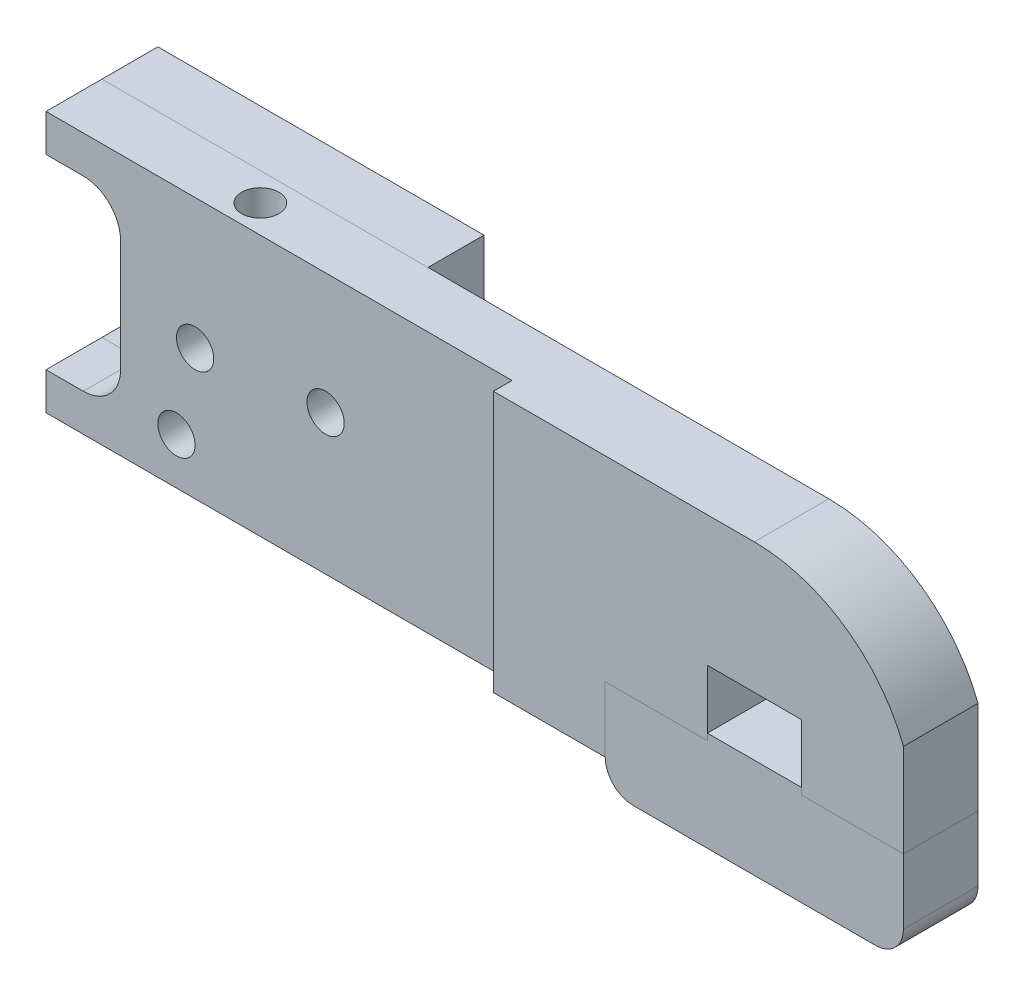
ISO-10303-21;
HEADER;
FILE_DESCRIPTION(('STEP AP214'),'2;1');
FILE_NAME('part.step','',(''),(''),'','','');
FILE_SCHEMA(('AUTOMOTIVE_DESIGN { 1 0 10303 214 1 1 1 1 }'));
ENDSEC;
DATA;
#1=APPLICATION_CONTEXT('core data for automotive mechanical design processes');
#2=APPLICATION_PROTOCOL_DEFINITION('international standard','automotive_design',2000,#1);
#3=PRODUCT_CONTEXT('',#1,'mechanical');
#4=PRODUCT('Part','Part','',(#3));
#5=PRODUCT_RELATED_PRODUCT_CATEGORY('part','',(#4));
#6=PRODUCT_DEFINITION_FORMATION('','',#4);
#7=PRODUCT_DEFINITION_CONTEXT('part definition',#1,'design');
#8=PRODUCT_DEFINITION('design','',#6,#7);
#9=PRODUCT_DEFINITION_SHAPE('','',#8);
#10=(LENGTH_UNIT() NAMED_UNIT(*) SI_UNIT(.MILLI.,.METRE.));
#11=(NAMED_UNIT(*) PLANE_ANGLE_UNIT() SI_UNIT($,.RADIAN.));
#12=(NAMED_UNIT(*) SI_UNIT($,.STERADIAN.) SOLID_ANGLE_UNIT());
#13=UNCERTAINTY_MEASURE_WITH_UNIT(LENGTH_MEASURE(1.E-05),#10,'distance_accuracy_value','');
#14=(GEOMETRIC_REPRESENTATION_CONTEXT(3) GLOBAL_UNCERTAINTY_ASSIGNED_CONTEXT((#13)) GLOBAL_UNIT_ASSIGNED_CONTEXT((#10,
#11,#12)) REPRESENTATION_CONTEXT('',''));
#15=CARTESIAN_POINT('',(0.,0.,0.));
#16=DIRECTION('',(0.,0.,1.));
#17=DIRECTION('',(1.,0.,0.));
#18=AXIS2_PLACEMENT_3D('',#15,#16,#17);
#19=CARTESIAN_POINT('',(52.3748,44.45,-15.875));
#20=DIRECTION('',(1.,0.,0.));
#21=DIRECTION('',(0.,1.,0.));
#22=AXIS2_PLACEMENT_3D('',#19,#20,#21);
#23=PLANE('',#22);
#24=CARTESIAN_POINT('',(52.3748,33.3248,-11.1252));
#25=DIRECTION('',(1.,0.,0.));
#26=DIRECTION('',(0.,1.,0.));
#27=AXIS2_PLACEMENT_3D('',#24,#25,#26);
#28=CIRCLE('',#27,2.3876);
#29=CARTESIAN_POINT('',(52.3748,35.7124,-11.1252));
#30=VERTEX_POINT('',#29);
#31=EDGE_CURVE('E206',#30,#30,#28,.T.);
#32=ORIENTED_EDGE('',*,*,#31,.F.);
#33=EDGE_LOOP('',(#32));
#34=FACE_BOUND('',#33,.T.);
#35=DIRECTION('',(0.,1.,0.));
#36=VECTOR('',#35,1.);
#37=CARTESIAN_POINT('',(52.3748,44.45,-6.35));
#38=LINE('',#37,#36);
#39=CARTESIAN_POINT('',(52.3748,0.,-6.35));
#40=VERTEX_POINT('',#39);
#41=CARTESIAN_POINT('',(52.3748,44.45,-6.35));
#42=VERTEX_POINT('',#41);
#43=EDGE_CURVE('E143',#40,#42,#38,.T.);
#44=ORIENTED_EDGE('',*,*,#43,.F.);
#45=DIRECTION('',(0.,0.,1.));
#46=VECTOR('',#45,1.);
#47=CARTESIAN_POINT('',(52.3748,0.,-15.875));
#48=LINE('',#47,#46);
#49=CARTESIAN_POINT('',(52.3748,0.,-15.875));
#50=VERTEX_POINT('',#49);
#51=EDGE_CURVE('E194',#50,#40,#48,.T.);
#52=ORIENTED_EDGE('',*,*,#51,.F.);
#53=DIRECTION('',(0.,1.,0.));
#54=VECTOR('',#53,1.);
#55=CARTESIAN_POINT('',(52.3748,44.45,-15.875));
#56=LINE('',#55,#54);
#57=CARTESIAN_POINT('',(52.3748,44.45,-15.875));
#58=VERTEX_POINT('',#57);
#59=EDGE_CURVE('E153',#50,#58,#56,.T.);
#60=ORIENTED_EDGE('',*,*,#59,.T.);
#61=DIRECTION('',(0.,0.,1.));
#62=VECTOR('',#61,1.);
#63=CARTESIAN_POINT('',(52.3748,44.45,-15.875));
#64=LINE('',#63,#62);
#65=EDGE_CURVE('E138',#58,#42,#64,.T.);
#66=ORIENTED_EDGE('',*,*,#65,.T.);
#67=EDGE_LOOP('',(#44,#52,#60,#66));
#68=FACE_BOUND('',#67,.T.);
#69=ADVANCED_FACE('F46',(#34,#68),#23,.T.);
#70=CARTESIAN_POINT('',(0.,0.,-15.875));
#71=DIRECTION('',(0.,-1.,0.));
#72=DIRECTION('',(0.,0.,-1.));
#73=AXIS2_PLACEMENT_3D('',#70,#71,#72);
#74=PLANE('',#73);
#75=DIRECTION('',(1.,0.,0.));
#76=VECTOR('',#75,1.);
#77=CARTESIAN_POINT('',(0.,0.,-6.35));
#78=LINE('',#77,#76);
#79=CARTESIAN_POINT('',(-3.17499999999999,0.,-6.35));
#80=VERTEX_POINT('',#79);
#81=EDGE_CURVE('E187',#80,#40,#78,.T.);
#82=ORIENTED_EDGE('',*,*,#81,.F.);
#83=DIRECTION('',(0.,0.,1.));
#84=VECTOR('',#83,1.);
#85=CARTESIAN_POINT('',(-3.17499999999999,0.,-15.875));
#86=LINE('',#85,#84);
#87=CARTESIAN_POINT('',(-3.17499999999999,0.,-15.875));
#88=VERTEX_POINT('',#87);
#89=EDGE_CURVE('E196',#88,#80,#86,.T.);
#90=ORIENTED_EDGE('',*,*,#89,.F.);
#91=DIRECTION('',(1.,0.,0.));
#92=VECTOR('',#91,1.);
#93=CARTESIAN_POINT('',(0.,0.,-15.875));
#94=LINE('',#93,#92);
#95=EDGE_CURVE('E169',#88,#50,#94,.T.);
#96=ORIENTED_EDGE('',*,*,#95,.T.);
#97=ORIENTED_EDGE('',*,*,#51,.T.);
#98=EDGE_LOOP('',(#82,#90,#96,#97));
#99=FACE_BOUND('',#98,.T.);
#100=ADVANCED_FACE('F253',(#99),#74,.T.);
#101=CARTESIAN_POINT('',(-3.17499999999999,0.,-15.875));
#102=DIRECTION('',(-1.,0.,0.));
#103=DIRECTION('',(0.,0.,1.));
#104=AXIS2_PLACEMENT_3D('',#101,#102,#103);
#105=PLANE('',#104);
#106=DIRECTION('',(0.,-1.,0.));
#107=VECTOR('',#106,1.);
#108=CARTESIAN_POINT('',(-3.17499999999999,0.,-6.35));
#109=LINE('',#108,#107);
#110=CARTESIAN_POINT('',(-3.17499999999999,6.35,-6.35));
#111=VERTEX_POINT('',#110);
#112=EDGE_CURVE('E184',#111,#80,#109,.T.);
#113=ORIENTED_EDGE('',*,*,#112,.F.);
#114=DIRECTION('',(0.,0.,1.));
#115=VECTOR('',#114,1.);
#116=CARTESIAN_POINT('',(-3.17499999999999,6.35,-15.875));
#117=LINE('',#116,#115);
#118=CARTESIAN_POINT('',(-3.17499999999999,6.35,-15.875));
#119=VERTEX_POINT('',#118);
#120=EDGE_CURVE('E199',#119,#111,#117,.T.);
#121=ORIENTED_EDGE('',*,*,#120,.F.);
#122=DIRECTION('',(0.,-1.,0.));
#123=VECTOR('',#122,1.);
#124=CARTESIAN_POINT('',(-3.17499999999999,0.,-15.875));
#125=LINE('',#124,#123);
#126=EDGE_CURVE('E166',#119,#88,#125,.T.);
#127=ORIENTED_EDGE('',*,*,#126,.T.);
#128=ORIENTED_EDGE('',*,*,#89,.T.);
#129=EDGE_LOOP('',(#113,#121,#127,#128));
#130=FACE_BOUND('',#129,.T.);
#131=ADVANCED_FACE('F257',(#130),#105,.T.);
#132=CARTESIAN_POINT('',(-3.17499999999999,6.35,-15.875));
#133=DIRECTION('',(0.,1.,0.));
#134=DIRECTION('',(-1.,0.,0.));
#135=AXIS2_PLACEMENT_3D('',#132,#133,#134);
#136=PLANE('',#135);
#137=DIRECTION('',(-1.,0.,0.));
#138=VECTOR('',#137,1.);
#139=CARTESIAN_POINT('',(-3.17499999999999,6.35,-6.35));
#140=LINE('',#139,#138);
#141=CARTESIAN_POINT('',(3.17500000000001,6.35,-6.35));
#142=VERTEX_POINT('',#141);
#143=EDGE_CURVE('E182',#142,#111,#140,.T.);
#144=ORIENTED_EDGE('',*,*,#143,.F.);
#145=DIRECTION('',(0.,0.,1.));
#146=VECTOR('',#145,1.);
#147=CARTESIAN_POINT('',(3.17500000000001,6.35,-15.875));
#148=LINE('',#147,#146);
#149=CARTESIAN_POINT('',(3.17500000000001,6.35,-15.875));
#150=VERTEX_POINT('',#149);
#151=EDGE_CURVE('E217',#142,#150,#148,.F.);
#152=ORIENTED_EDGE('',*,*,#151,.T.);
#153=DIRECTION('',(-1.,0.,0.));
#154=VECTOR('',#153,1.);
#155=CARTESIAN_POINT('',(9.52500000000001,6.35,-15.875));
#156=LINE('',#155,#154);
#157=EDGE_CURVE('E164',#150,#119,#156,.T.);
#158=ORIENTED_EDGE('',*,*,#157,.T.);
#159=ORIENTED_EDGE('',*,*,#120,.T.);
#160=EDGE_LOOP('',(#144,#152,#158,#159));
#161=FACE_BOUND('',#160,.T.);
#162=ADVANCED_FACE('F261',(#161),#136,.T.);
#163=CARTESIAN_POINT('',(9.525,38.1,-15.875));
#164=DIRECTION('',(-1.,0.,0.));
#165=DIRECTION('',(0.,-1.,0.));
#166=AXIS2_PLACEMENT_3D('',#163,#164,#165);
#167=PLANE('',#166);
#168=DIRECTION('',(0.,-1.,0.));
#169=VECTOR('',#168,1.);
#170=CARTESIAN_POINT('',(9.525,38.1,-15.875));
#171=LINE('',#170,#169);
#172=CARTESIAN_POINT('',(9.525,31.75,-15.875));
#173=VERTEX_POINT('',#172);
#174=CARTESIAN_POINT('',(9.52500000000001,12.7,-15.875));
#175=VERTEX_POINT('',#174);
#176=EDGE_CURVE('E158',#173,#175,#171,.T.);
#177=ORIENTED_EDGE('',*,*,#176,.T.);
#178=DIRECTION('',(0.,0.,1.));
#179=VECTOR('',#178,1.);
#180=CARTESIAN_POINT('',(9.52500000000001,12.7,-6.35));
#181=LINE('',#180,#179);
#182=CARTESIAN_POINT('',(9.52500000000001,12.7,-6.35));
#183=VERTEX_POINT('',#182);
#184=EDGE_CURVE('E214',#175,#183,#181,.T.);
#185=ORIENTED_EDGE('',*,*,#184,.T.);
#186=DIRECTION('',(0.,-1.,0.));
#187=VECTOR('',#186,1.);
#188=CARTESIAN_POINT('',(9.525,38.1,-6.35));
#189=LINE('',#188,#187);
#190=CARTESIAN_POINT('',(9.525,31.75,-6.35));
#191=VERTEX_POINT('',#190);
#192=EDGE_CURVE('E179',#191,#183,#189,.T.);
#193=ORIENTED_EDGE('',*,*,#192,.F.);
#194=DIRECTION('',(0.,0.,1.));
#195=VECTOR('',#194,1.);
#196=CARTESIAN_POINT('',(9.525,31.75,-15.875));
#197=LINE('',#196,#195);
#198=CARTESIAN_POINT('',(9.525,31.75,-9.33058619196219));
#199=VERTEX_POINT('',#198);
#200=EDGE_CURVE('E212',#191,#199,#197,.F.);
#201=ORIENTED_EDGE('',*,*,#200,.T.);
#202=CARTESIAN_POINT('',(9.525,33.3248,-11.1252));
#203=DIRECTION('',(-1.,0.,0.));
#204=DIRECTION('',(0.,-1.,0.));
#205=AXIS2_PLACEMENT_3D('',#202,#203,#204);
#206=CIRCLE('',#205,2.3876);
#207=CARTESIAN_POINT('',(9.525,31.75,-12.9198138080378));
#208=VERTEX_POINT('',#207);
#209=EDGE_CURVE('E207',#208,#199,#206,.T.);
#210=ORIENTED_EDGE('',*,*,#209,.F.);
#211=DIRECTION('',(0.,0.,1.));
#212=VECTOR('',#211,1.);
#213=CARTESIAN_POINT('',(9.525,31.75,-15.875));
#214=LINE('',#213,#212);
#215=EDGE_CURVE('E193',#208,#173,#214,.F.);
#216=ORIENTED_EDGE('',*,*,#215,.T.);
#217=EDGE_LOOP('',(#177,#185,#193,#201,#210,#216));
#218=FACE_BOUND('',#217,.T.);
#219=ADVANCED_FACE('F265',(#218),#167,.T.);
#220=CARTESIAN_POINT('',(9.525,38.1,-15.875));
#221=DIRECTION('',(0.,-1.,0.));
#222=DIRECTION('',(0.,0.,-1.));
#223=AXIS2_PLACEMENT_3D('',#220,#221,#222);
#224=PLANE('',#223);
#225=DIRECTION('',(1.,0.,0.));
#226=VECTOR('',#225,1.);
#227=CARTESIAN_POINT('',(-3.17499999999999,38.1,-15.875));
#228=LINE('',#227,#226);
#229=CARTESIAN_POINT('',(-3.17499999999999,38.1,-15.875));
#230=VERTEX_POINT('',#229);
#231=CARTESIAN_POINT('',(3.175,38.1,-15.875));
#232=VERTEX_POINT('',#231);
#233=EDGE_CURVE('E156',#230,#232,#228,.T.);
#234=ORIENTED_EDGE('',*,*,#233,.T.);
#235=DIRECTION('',(0.,0.,1.));
#236=VECTOR('',#235,1.);
#237=CARTESIAN_POINT('',(3.175,38.1,-6.35));
#238=LINE('',#237,#236);
#239=CARTESIAN_POINT('',(3.175,38.1,-6.35));
#240=VERTEX_POINT('',#239);
#241=EDGE_CURVE('E219',#232,#240,#238,.T.);
#242=ORIENTED_EDGE('',*,*,#241,.T.);
#243=DIRECTION('',(1.,0.,0.));
#244=VECTOR('',#243,1.);
#245=CARTESIAN_POINT('',(9.525,38.1,-6.35));
#246=LINE('',#245,#244);
#247=CARTESIAN_POINT('',(-3.17499999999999,38.1,-6.35));
#248=VERTEX_POINT('',#247);
#249=EDGE_CURVE('E176',#248,#240,#246,.T.);
#250=ORIENTED_EDGE('',*,*,#249,.F.);
#251=DIRECTION('',(0.,0.,1.));
#252=VECTOR('',#251,1.);
#253=CARTESIAN_POINT('',(-3.17499999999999,38.1,-15.875));
#254=LINE('',#253,#252);
#255=EDGE_CURVE('E152',#230,#248,#254,.T.);
#256=ORIENTED_EDGE('',*,*,#255,.F.);
#257=EDGE_LOOP('',(#234,#242,#250,#256));
#258=FACE_BOUND('',#257,.T.);
#259=ADVANCED_FACE('F269',(#258),#224,.T.);
#260=CARTESIAN_POINT('',(-3.17499999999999,44.45,-15.875));
#261=DIRECTION('',(-1.,0.,0.));
#262=DIRECTION('',(0.,-1.,0.));
#263=AXIS2_PLACEMENT_3D('',#260,#261,#262);
#264=PLANE('',#263);
#265=DIRECTION('',(0.,-1.,0.));
#266=VECTOR('',#265,1.);
#267=CARTESIAN_POINT('',(-3.17499999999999,44.45,-6.35));
#268=LINE('',#267,#266);
#269=CARTESIAN_POINT('',(-3.17499999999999,44.45,-6.35));
#270=VERTEX_POINT('',#269);
#271=EDGE_CURVE('E150',#270,#248,#268,.T.);
#272=ORIENTED_EDGE('',*,*,#271,.F.);
#273=DIRECTION('',(0.,0.,1.));
#274=VECTOR('',#273,1.);
#275=CARTESIAN_POINT('',(-3.17499999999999,44.45,-15.875));
#276=LINE('',#275,#274);
#277=CARTESIAN_POINT('',(-3.17499999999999,44.45,-15.875));
#278=VERTEX_POINT('',#277);
#279=EDGE_CURVE('E135',#278,#270,#276,.T.);
#280=ORIENTED_EDGE('',*,*,#279,.F.);
#281=DIRECTION('',(0.,-1.,0.));
#282=VECTOR('',#281,1.);
#283=CARTESIAN_POINT('',(-3.17499999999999,44.45,-15.875));
#284=LINE('',#283,#282);
#285=EDGE_CURVE('E142',#278,#230,#284,.T.);
#286=ORIENTED_EDGE('',*,*,#285,.T.);
#287=ORIENTED_EDGE('',*,*,#255,.T.);
#288=EDGE_LOOP('',(#272,#280,#286,#287));
#289=FACE_BOUND('',#288,.T.);
#290=ADVANCED_FACE('F147',(#289),#264,.T.);
#291=CARTESIAN_POINT('',(0.,44.45,-15.875));
#292=DIRECTION('',(0.,1.,0.));
#293=DIRECTION('',(0.,0.,1.));
#294=AXIS2_PLACEMENT_3D('',#291,#292,#293);
#295=PLANE('',#294);
#296=DIRECTION('',(-1.,0.,0.));
#297=VECTOR('',#296,1.);
#298=CARTESIAN_POINT('',(0.,44.45,-6.35));
#299=LINE('',#298,#297);
#300=EDGE_CURVE('E172',#42,#270,#299,.T.);
#301=ORIENTED_EDGE('',*,*,#300,.F.);
#302=ORIENTED_EDGE('',*,*,#65,.F.);
#303=DIRECTION('',(-1.,0.,0.));
#304=VECTOR('',#303,1.);
#305=CARTESIAN_POINT('',(52.3748,44.45,-15.875));
#306=LINE('',#305,#304);
#307=EDGE_CURVE('E132',#58,#278,#306,.T.);
#308=ORIENTED_EDGE('',*,*,#307,.T.);
#309=ORIENTED_EDGE('',*,*,#279,.T.);
#310=EDGE_LOOP('',(#301,#302,#308,#309));
#311=FACE_BOUND('',#310,.T.);
#312=ADVANCED_FACE('F134',(#311),#295,.T.);
#313=CARTESIAN_POINT('',(0.,0.,-15.875));
#314=DIRECTION('',(0.,0.,1.));
#315=DIRECTION('',(1.,0.,0.));
#316=AXIS2_PLACEMENT_3D('',#313,#314,#315);
#317=PLANE('',#316);
#318=CARTESIAN_POINT('',(44.45,23.8252,-15.875));
#319=DIRECTION('',(0.,0.,1.));
#320=DIRECTION('',(1.,0.,0.));
#321=AXIS2_PLACEMENT_3D('',#318,#319,#320);
#322=CIRCLE('',#321,4.7625);
#323=CARTESIAN_POINT('',(49.2125,23.8252,-15.875));
#324=VERTEX_POINT('',#323);
#325=EDGE_CURVE('E51',#324,#324,#322,.T.);
#326=ORIENTED_EDGE('',*,*,#325,.T.);
#327=EDGE_LOOP('',(#326));
#328=FACE_BOUND('',#327,.T.);
#329=CARTESIAN_POINT('',(19.05,7.9248,-15.875));
#330=DIRECTION('',(0.,0.,1.));
#331=DIRECTION('',(1.,0.,0.));
#332=AXIS2_PLACEMENT_3D('',#329,#330,#331);
#333=CIRCLE('',#332,4.7625);
#334=CARTESIAN_POINT('',(23.8125,7.9248,-15.875));
#335=VERTEX_POINT('',#334);
#336=EDGE_CURVE('E318',#335,#335,#333,.T.);
#337=ORIENTED_EDGE('',*,*,#336,.T.);
#338=EDGE_LOOP('',(#337));
#339=FACE_BOUND('',#338,.T.);
#340=CARTESIAN_POINT('',(22.225,22.225,-15.875));
#341=DIRECTION('',(0.,0.,1.));
#342=DIRECTION('',(1.,0.,0.));
#343=AXIS2_PLACEMENT_3D('',#340,#341,#342);
#344=CIRCLE('',#343,3.175);
#345=CARTESIAN_POINT('',(25.4,22.225,-15.875));
#346=VERTEX_POINT('',#345);
#347=EDGE_CURVE('E174',#346,#346,#344,.T.);
#348=ORIENTED_EDGE('',*,*,#347,.T.);
#349=EDGE_LOOP('',(#348));
#350=FACE_BOUND('',#349,.T.);
#351=ORIENTED_EDGE('',*,*,#307,.F.);
#352=ORIENTED_EDGE('',*,*,#59,.F.);
#353=ORIENTED_EDGE('',*,*,#95,.F.);
#354=ORIENTED_EDGE('',*,*,#126,.F.);
#355=ORIENTED_EDGE('',*,*,#157,.F.);
#356=CARTESIAN_POINT('',(3.17500000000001,12.7,-15.875));
#357=DIRECTION('',(0.,0.,1.));
#358=DIRECTION('',(1.,0.,0.));
#359=AXIS2_PLACEMENT_3D('',#356,#357,#358);
#360=CIRCLE('',#359,6.35);
#361=EDGE_CURVE('E223',#150,#175,#360,.T.);
#362=ORIENTED_EDGE('',*,*,#361,.T.);
#363=ORIENTED_EDGE('',*,*,#176,.F.);
#364=CARTESIAN_POINT('',(3.175,31.75,-15.875));
#365=DIRECTION('',(0.,0.,1.));
#366=DIRECTION('',(1.,0.,0.));
#367=AXIS2_PLACEMENT_3D('',#364,#365,#366);
#368=CIRCLE('',#367,6.35);
#369=EDGE_CURVE('E12',#173,#232,#368,.T.);
#370=ORIENTED_EDGE('',*,*,#369,.T.);
#371=ORIENTED_EDGE('',*,*,#233,.F.);
#372=ORIENTED_EDGE('',*,*,#285,.F.);
#373=EDGE_LOOP('',(#351,#352,#353,#354,#355,#362,#363,#370,#371,#372));
#374=FACE_BOUND('',#373,.T.);
#375=ADVANCED_FACE('F155',(#328,#339,#350,#374),#317,.F.);
#376=CARTESIAN_POINT('',(0.,0.,-6.35));
#377=DIRECTION('',(0.,0.,1.));
#378=DIRECTION('',(1.,0.,0.));
#379=AXIS2_PLACEMENT_3D('',#376,#377,#378);
#380=PLANE('',#379);
#381=CARTESIAN_POINT('',(19.05,7.9248,-6.35));
#382=DIRECTION('',(0.,0.,1.));
#383=DIRECTION('',(1.,0.,0.));
#384=AXIS2_PLACEMENT_3D('',#381,#382,#383);
#385=CIRCLE('',#384,3.175);
#386=CARTESIAN_POINT('',(22.225,7.9248,-6.35));
#387=VERTEX_POINT('',#386);
#388=EDGE_CURVE('E210',#387,#387,#385,.T.);
#389=ORIENTED_EDGE('',*,*,#388,.F.);
#390=EDGE_LOOP('',(#389));
#391=FACE_BOUND('',#390,.T.);
#392=CARTESIAN_POINT('',(44.45,23.8252,-6.35));
#393=DIRECTION('',(0.,0.,1.));
#394=DIRECTION('',(1.,0.,0.));
#395=AXIS2_PLACEMENT_3D('',#392,#393,#394);
#396=CIRCLE('',#395,3.175);
#397=CARTESIAN_POINT('',(47.625,23.8252,-6.35));
#398=VERTEX_POINT('',#397);
#399=EDGE_CURVE('E316',#398,#398,#396,.T.);
#400=ORIENTED_EDGE('',*,*,#399,.F.);
#401=EDGE_LOOP('',(#400));
#402=FACE_BOUND('',#401,.T.);
#403=CARTESIAN_POINT('',(22.225,22.225,-6.35));
#404=DIRECTION('',(0.,0.,1.));
#405=DIRECTION('',(1.,0.,0.));
#406=AXIS2_PLACEMENT_3D('',#403,#404,#405);
#407=CIRCLE('',#406,3.175);
#408=CARTESIAN_POINT('',(25.4,22.225,-6.35));
#409=VERTEX_POINT('',#408);
#410=EDGE_CURVE('E203',#409,#409,#407,.T.);
#411=ORIENTED_EDGE('',*,*,#410,.F.);
#412=EDGE_LOOP('',(#411));
#413=FACE_BOUND('',#412,.T.);
#414=ORIENTED_EDGE('',*,*,#43,.T.);
#415=ORIENTED_EDGE('',*,*,#300,.T.);
#416=ORIENTED_EDGE('',*,*,#271,.T.);
#417=ORIENTED_EDGE('',*,*,#249,.T.);
#418=CARTESIAN_POINT('',(3.175,31.75,-6.35));
#419=DIRECTION('',(0.,0.,1.));
#420=DIRECTION('',(1.,0.,0.));
#421=AXIS2_PLACEMENT_3D('',#418,#419,#420);
#422=CIRCLE('',#421,6.35);
#423=EDGE_CURVE('E70',#240,#191,#422,.F.);
#424=ORIENTED_EDGE('',*,*,#423,.T.);
#425=ORIENTED_EDGE('',*,*,#192,.T.);
#426=CARTESIAN_POINT('',(3.17500000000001,12.7,-6.35));
#427=DIRECTION('',(0.,0.,1.));
#428=DIRECTION('',(1.,0.,0.));
#429=AXIS2_PLACEMENT_3D('',#426,#427,#428);
#430=CIRCLE('',#429,6.35);
#431=EDGE_CURVE('E221',#183,#142,#430,.F.);
#432=ORIENTED_EDGE('',*,*,#431,.T.);
#433=ORIENTED_EDGE('',*,*,#143,.T.);
#434=ORIENTED_EDGE('',*,*,#112,.T.);
#435=ORIENTED_EDGE('',*,*,#81,.T.);
#436=EDGE_LOOP('',(#414,#415,#416,#417,#424,#425,#432,#433,#434,#435));
#437=FACE_BOUND('',#436,.T.);
#438=ADVANCED_FACE('F243',(#391,#402,#413,#437),#380,.T.);
#439=CARTESIAN_POINT('',(22.225,22.225,-25.4));
#440=DIRECTION('',(0.,0.,1.));
#441=DIRECTION('',(1.,0.,0.));
#442=AXIS2_PLACEMENT_3D('',#439,#440,#441);
#443=CYLINDRICAL_SURFACE('',#442,3.175);
#444=ORIENTED_EDGE('',*,*,#410,.T.);
#445=EDGE_LOOP('',(#444));
#446=FACE_BOUND('',#445,.T.);
#447=ORIENTED_EDGE('',*,*,#347,.F.);
#448=EDGE_LOOP('',(#447));
#449=FACE_BOUND('',#448,.T.);
#450=ADVANCED_FACE('F237',(#446,#449),#443,.F.);
#451=CARTESIAN_POINT('',(-22.86,33.3248,-11.1252));
#452=DIRECTION('',(1.,0.,0.));
#453=DIRECTION('',(0.,0.,-1.));
#454=AXIS2_PLACEMENT_3D('',#451,#452,#453);
#455=CYLINDRICAL_SURFACE('',#454,2.3876);
#456=ORIENTED_EDGE('',*,*,#31,.T.);
#457=EDGE_LOOP('',(#456));
#458=FACE_BOUND('',#457,.T.);
#459=ORIENTED_EDGE('',*,*,#209,.T.);
#460=CARTESIAN_POINT('',(9.525,31.75,-9.33058619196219));
#461=CARTESIAN_POINT('',(9.52500319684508,31.7983381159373,-9.28815911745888));
#462=CARTESIAN_POINT('',(9.52444814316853,31.8484010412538,-9.24769534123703));
#463=CARTESIAN_POINT('',(9.52200780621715,31.9516095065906,-9.17094592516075));
#464=CARTESIAN_POINT('',(9.52012239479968,32.0047553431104,-9.13466068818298));
#465=CARTESIAN_POINT('',(9.51480989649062,32.1137046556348,-9.06655848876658));
#466=CARTESIAN_POINT('',(9.51138418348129,32.1695057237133,-9.03473757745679));
#467=CARTESIAN_POINT('',(9.50281892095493,32.2833634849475,-8.9757439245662));
#468=CARTESIAN_POINT('',(9.49767948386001,32.3414200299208,-8.94857087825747));
#469=CARTESIAN_POINT('',(9.47943854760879,32.5184861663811,-8.87423492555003));
#470=CARTESIAN_POINT('',(9.46351640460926,32.6403451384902,-8.83428454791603));
#471=CARTESIAN_POINT('',(9.42354728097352,32.8874699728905,-8.77454958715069));
#472=CARTESIAN_POINT('',(9.3995043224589,33.0127341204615,-8.75475504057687));
#473=CARTESIAN_POINT('',(9.34362513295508,33.262215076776,-8.73516467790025));
#474=CARTESIAN_POINT('',(9.31183995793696,33.386433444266,-8.73524120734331));
#475=CARTESIAN_POINT('',(9.24122783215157,33.6313977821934,-8.7541777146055));
#476=CARTESIAN_POINT('',(9.20239701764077,33.7521418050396,-8.7730480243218));
#477=CARTESIAN_POINT('',(9.11658325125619,33.9944527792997,-8.82985917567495));
#478=CARTESIAN_POINT('',(9.06925406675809,34.1156463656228,-8.86886150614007));
#479=CARTESIAN_POINT('',(8.97023045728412,34.3488225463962,-8.96466336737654));
#480=CARTESIAN_POINT('',(8.91853491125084,34.4608027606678,-9.02146747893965));
#481=CARTESIAN_POINT('',(8.80736375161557,34.6853544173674,-9.15831593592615));
#482=CARTESIAN_POINT('',(8.74765060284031,34.7966854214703,-9.24020680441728));
#483=CARTESIAN_POINT('',(8.62915649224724,35.0040705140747,-9.42233152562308));
#484=CARTESIAN_POINT('',(8.57037695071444,35.1001030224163,-9.52259086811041));
#485=CARTESIAN_POINT('',(8.45496116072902,35.2793727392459,-9.74609445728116));
#486=CARTESIAN_POINT('',(8.3986213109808,35.361613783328,-9.87030057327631));
#487=CARTESIAN_POINT('',(8.29811763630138,35.5028273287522,-10.135628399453));
#488=CARTESIAN_POINT('',(8.25391957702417,35.5618654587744,-10.2767009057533));
#489=CARTESIAN_POINT('',(8.19542257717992,35.6383681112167,-10.5257484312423));
#490=CARTESIAN_POINT('',(8.17609858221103,35.6630544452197,-10.630342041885));
#491=CARTESIAN_POINT('',(8.1484464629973,35.6981446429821,-10.8432895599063));
#492=CARTESIAN_POINT('',(8.14010656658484,35.7085637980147,-10.9516393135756));
#493=CARTESIAN_POINT('',(8.13538540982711,35.714479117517,-11.1692314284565));
#494=CARTESIAN_POINT('',(8.13902841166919,35.7099450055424,-11.2784751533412));
#495=CARTESIAN_POINT('',(8.157882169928,35.6861913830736,-11.4943493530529));
#496=CARTESIAN_POINT('',(8.17309936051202,35.6669637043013,-11.6009783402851));
#497=CARTESIAN_POINT('',(8.2130854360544,35.6153878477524,-11.8070705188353));
#498=CARTESIAN_POINT('',(8.23768802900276,35.5832676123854,-11.9066245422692));
#499=CARTESIAN_POINT('',(8.29431876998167,35.5073013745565,-12.0988622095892));
#500=CARTESIAN_POINT('',(8.3263495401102,35.4634512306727,-12.1915434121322));
#501=CARTESIAN_POINT('',(8.40122458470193,35.3574806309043,-12.3832465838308));
#502=CARTESIAN_POINT('',(8.44497893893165,35.293560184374,-12.4809142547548));
#503=CARTESIAN_POINT('',(8.53658597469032,35.1533691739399,-12.6647965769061));
#504=CARTESIAN_POINT('',(8.58444173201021,35.0770893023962,-12.7510025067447));
#505=CARTESIAN_POINT('',(8.69125442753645,34.8974378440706,-12.9269177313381));
#506=CARTESIAN_POINT('',(8.75054993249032,34.7916862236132,-13.0140065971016));
#507=CARTESIAN_POINT('',(8.86772691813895,34.5662943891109,-13.1692307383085));
#508=CARTESIAN_POINT('',(8.9256075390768,34.4466459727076,-13.2373547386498));
#509=CARTESIAN_POINT('',(9.0402224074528,34.1878026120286,-13.3561986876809));
#510=CARTESIAN_POINT('',(9.09666490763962,34.047856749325,-13.4055833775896));
#511=CARTESIAN_POINT('',(9.20102441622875,33.7582691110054,-13.4778483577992));
#512=CARTESIAN_POINT('',(9.24894829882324,33.6086352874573,-13.5007501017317));
#513=CARTESIAN_POINT('',(9.33005521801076,33.31797521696,-13.5168269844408));
#514=CARTESIAN_POINT('',(9.3641619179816,33.1773435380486,-13.5124309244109));
#515=CARTESIAN_POINT('',(9.42218678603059,32.8969973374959,-13.4783922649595));
#516=CARTESIAN_POINT('',(9.44610861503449,32.7572825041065,-13.4487587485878));
#517=CARTESIAN_POINT('',(9.48208931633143,32.4974540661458,-13.3685957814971));
#518=CARTESIAN_POINT('',(9.49507094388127,32.376750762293,-13.3203614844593));
#519=CARTESIAN_POINT('',(9.51380532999,32.1444502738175,-13.2046675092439));
#520=CARTESIAN_POINT('',(9.51956890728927,32.0328396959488,-13.1372367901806));
#521=CARTESIAN_POINT('',(9.52337751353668,31.8968314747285,-13.039092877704));
#522=CARTESIAN_POINT('',(9.523998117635,31.8666467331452,-13.0161952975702));
#523=CARTESIAN_POINT('',(9.52480853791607,31.8074496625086,-12.969029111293));
#524=CARTESIAN_POINT('',(9.52499911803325,31.7784353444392,-12.9447630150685));
#525=CARTESIAN_POINT('',(9.525,31.75,-12.9198138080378));
#526=B_SPLINE_CURVE_WITH_KNOTS('',3,(#460,#461,#462,#463,#464,#465,#466,#467,#468,#469,#470,
#471,#472,#473,#474,#475,#476,#477,#478,#479,#480,#481,#482,#483,#484,#485,#486,#487,#488,#489,
#490,#491,#492,#493,#494,#495,#496,#497,#498,#499,#500,#501,#502,#503,#504,#505,#506,#507,#508,
#509,#510,#511,#512,#513,#514,#515,#516,#517,#518,#519,#520,#521,#522,#523,#524,#525),
.UNSPECIFIED.,.F.,.F.,(4,2,2,2,2,2,2,2,2,2,2,2,2,2,2,2,2,2,2,2,2,2,2,2,2,2,2,2,2,2,2,2,4),(0.,
0.192895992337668,0.385810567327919,0.578553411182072,0.771283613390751,1.15690851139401,
1.54234269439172,1.92530085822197,2.30846966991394,2.71429128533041,3.120217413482,
3.56995179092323,4.02031505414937,4.49548539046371,4.96930188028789,5.29550124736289,
5.621350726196,5.9478603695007,6.2745516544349,6.59570491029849,6.91697170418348,
7.28958854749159,7.66248731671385,8.10841760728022,8.55461245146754,9.02837360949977,
9.50175070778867,9.93365089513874,10.3653957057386,10.7554326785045,11.1448843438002,
11.2585311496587,11.3719759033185),.UNSPECIFIED.);
#527=EDGE_CURVE('E56',#199,#208,#526,.T.);
#528=ORIENTED_EDGE('',*,*,#527,.T.);
#529=EDGE_LOOP('',(#459,#528));
#530=FACE_BOUND('',#529,.T.);
#531=ADVANCED_FACE('F231',(#458,#530),#455,.F.);
#532=CARTESIAN_POINT('',(3.17500000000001,12.7,-15.875));
#533=DIRECTION('',(0.,0.,-1.));
#534=DIRECTION('',(-1.,0.,0.));
#535=AXIS2_PLACEMENT_3D('',#532,#533,#534);
#536=CYLINDRICAL_SURFACE('',#535,6.35);
#537=ORIENTED_EDGE('',*,*,#361,.F.);
#538=ORIENTED_EDGE('',*,*,#151,.F.);
#539=ORIENTED_EDGE('',*,*,#431,.F.);
#540=ORIENTED_EDGE('',*,*,#184,.F.);
#541=EDGE_LOOP('',(#537,#538,#539,#540));
#542=FACE_BOUND('',#541,.T.);
#543=ADVANCED_FACE('F236',(#542),#536,.F.);
#544=CARTESIAN_POINT('',(3.175,31.75,-15.875));
#545=DIRECTION('',(0.,0.,-1.));
#546=DIRECTION('',(-1.,0.,0.));
#547=AXIS2_PLACEMENT_3D('',#544,#545,#546);
#548=CYLINDRICAL_SURFACE('',#547,6.35);
#549=ORIENTED_EDGE('',*,*,#527,.F.);
#550=ORIENTED_EDGE('',*,*,#200,.F.);
#551=ORIENTED_EDGE('',*,*,#423,.F.);
#552=ORIENTED_EDGE('',*,*,#241,.F.);
#553=ORIENTED_EDGE('',*,*,#369,.F.);
#554=ORIENTED_EDGE('',*,*,#215,.F.);
#555=EDGE_LOOP('',(#549,#550,#551,#552,#553,#554));
#556=FACE_BOUND('',#555,.T.);
#557=ADVANCED_FACE('F48',(#556),#548,.F.);
#558=CARTESIAN_POINT('',(44.45,23.8252,-25.4));
#559=DIRECTION('',(0.,0.,1.));
#560=DIRECTION('',(1.,0.,0.));
#561=AXIS2_PLACEMENT_3D('',#558,#559,#560);
#562=CYLINDRICAL_SURFACE('',#561,3.175);
#563=CARTESIAN_POINT('',(44.45,23.8252,-9.525));
#564=DIRECTION('',(0.,0.,1.));
#565=DIRECTION('',(1.,0.,0.));
#566=AXIS2_PLACEMENT_3D('',#563,#564,#565);
#567=CIRCLE('',#566,3.175);
#568=CARTESIAN_POINT('',(47.625,23.8252,-9.525));
#569=VERTEX_POINT('',#568);
#570=EDGE_CURVE('E313',#569,#569,#567,.F.);
#571=ORIENTED_EDGE('',*,*,#570,.T.);
#572=EDGE_LOOP('',(#571));
#573=FACE_BOUND('',#572,.T.);
#574=ORIENTED_EDGE('',*,*,#399,.T.);
#575=EDGE_LOOP('',(#574));
#576=FACE_BOUND('',#575,.T.);
#577=ADVANCED_FACE('F239',(#573,#576),#562,.F.);
#578=CARTESIAN_POINT('',(19.05,7.9248,-25.4));
#579=DIRECTION('',(0.,0.,1.));
#580=DIRECTION('',(1.,0.,0.));
#581=AXIS2_PLACEMENT_3D('',#578,#579,#580);
#582=CYLINDRICAL_SURFACE('',#581,3.175);
#583=CARTESIAN_POINT('',(19.05,7.9248,-9.525));
#584=DIRECTION('',(0.,0.,1.));
#585=DIRECTION('',(1.,0.,0.));
#586=AXIS2_PLACEMENT_3D('',#583,#584,#585);
#587=CIRCLE('',#586,3.175);
#588=CARTESIAN_POINT('',(22.225,7.9248,-9.525));
#589=VERTEX_POINT('',#588);
#590=EDGE_CURVE('E322',#589,#589,#587,.F.);
#591=ORIENTED_EDGE('',*,*,#590,.T.);
#592=EDGE_LOOP('',(#591));
#593=FACE_BOUND('',#592,.T.);
#594=ORIENTED_EDGE('',*,*,#388,.T.);
#595=EDGE_LOOP('',(#594));
#596=FACE_BOUND('',#595,.T.);
#597=ADVANCED_FACE('F303',(#593,#596),#582,.F.);
#598=CARTESIAN_POINT('',(19.05,7.9248,-60.325));
#599=DIRECTION('',(0.,0.,1.));
#600=DIRECTION('',(1.,0.,0.));
#601=AXIS2_PLACEMENT_3D('',#598,#599,#600);
#602=CYLINDRICAL_SURFACE('',#601,4.7625);
#603=CARTESIAN_POINT('',(19.05,7.9248,-9.525));
#604=DIRECTION('',(0.,0.,1.));
#605=DIRECTION('',(1.,0.,0.));
#606=AXIS2_PLACEMENT_3D('',#603,#604,#605);
#607=CIRCLE('',#606,4.7625);
#608=CARTESIAN_POINT('',(23.8125,7.9248,-9.525));
#609=VERTEX_POINT('',#608);
#610=EDGE_CURVE('E326',#609,#609,#607,.T.);
#611=ORIENTED_EDGE('',*,*,#610,.T.);
#612=EDGE_LOOP('',(#611));
#613=FACE_BOUND('',#612,.T.);
#614=ORIENTED_EDGE('',*,*,#336,.F.);
#615=EDGE_LOOP('',(#614));
#616=FACE_BOUND('',#615,.T.);
#617=ADVANCED_FACE('F308',(#613,#616),#602,.F.);
#618=CARTESIAN_POINT('',(19.05,7.9248,-9.525));
#619=DIRECTION('',(0.,0.,1.));
#620=DIRECTION('',(1.,0.,0.));
#621=AXIS2_PLACEMENT_3D('',#618,#619,#620);
#622=PLANE('',#621);
#623=ORIENTED_EDGE('',*,*,#610,.F.);
#624=EDGE_LOOP('',(#623));
#625=FACE_BOUND('',#624,.T.);
#626=ORIENTED_EDGE('',*,*,#590,.F.);
#627=EDGE_LOOP('',(#626));
#628=FACE_BOUND('',#627,.T.);
#629=ADVANCED_FACE('F346',(#625,#628),#622,.F.);
#630=CARTESIAN_POINT('',(44.45,23.8252,-60.325));
#631=DIRECTION('',(0.,0.,1.));
#632=DIRECTION('',(1.,0.,0.));
#633=AXIS2_PLACEMENT_3D('',#630,#631,#632);
#634=CYLINDRICAL_SURFACE('',#633,4.7625);
#635=CARTESIAN_POINT('',(44.45,23.8252,-9.525));
#636=DIRECTION('',(0.,0.,1.));
#637=DIRECTION('',(1.,0.,0.));
#638=AXIS2_PLACEMENT_3D('',#635,#636,#637);
#639=CIRCLE('',#638,4.7625);
#640=CARTESIAN_POINT('',(49.2125,23.8252,-9.525));
#641=VERTEX_POINT('',#640);
#642=EDGE_CURVE('E327',#641,#641,#639,.T.);
#643=ORIENTED_EDGE('',*,*,#642,.T.);
#644=EDGE_LOOP('',(#643));
#645=FACE_BOUND('',#644,.T.);
#646=ORIENTED_EDGE('',*,*,#325,.F.);
#647=EDGE_LOOP('',(#646));
#648=FACE_BOUND('',#647,.T.);
#649=ADVANCED_FACE('F349',(#645,#648),#634,.F.);
#650=CARTESIAN_POINT('',(44.45,23.8252,-9.525));
#651=DIRECTION('',(0.,0.,1.));
#652=DIRECTION('',(1.,0.,0.));
#653=AXIS2_PLACEMENT_3D('',#650,#651,#652);
#654=PLANE('',#653);
#655=ORIENTED_EDGE('',*,*,#642,.F.);
#656=EDGE_LOOP('',(#655));
#657=FACE_BOUND('',#656,.T.);
#658=ORIENTED_EDGE('',*,*,#570,.F.);
#659=EDGE_LOOP('',(#658));
#660=FACE_BOUND('',#659,.T.);
#661=ADVANCED_FACE('F360',(#657,#660),#654,.F.);
#662=CLOSED_SHELL('',(#69,#100,#131,#162,#219,#259,#290,#312,#375,#438,#450,#531,#543,#557,#577,
#597,#617,#629,#649,#661));
#663=MANIFOLD_SOLID_BREP('B2',#662);
#664=CARTESIAN_POINT('',(138.1125,25.4254,0.));
#665=DIRECTION('',(0.,-1.,0.));
#666=DIRECTION('',(1.,0.,0.));
#667=AXIS2_PLACEMENT_3D('',#664,#665,#666);
#668=CYLINDRICAL_SURFACE('',#667,3.175);
#669=CARTESIAN_POINT('',(138.1125,11.1252,0.));
#670=DIRECTION('',(0.,-1.,0.));
#671=DIRECTION('',(1.,0.,0.));
#672=AXIS2_PLACEMENT_3D('',#669,#670,#671);
#673=CIRCLE('',#672,3.175);
#674=CARTESIAN_POINT('',(141.2875,11.1252,0.));
#675=VERTEX_POINT('',#674);
#676=EDGE_CURVE('E766',#675,#675,#673,.T.);
#677=ORIENTED_EDGE('',*,*,#676,.F.);
#678=EDGE_LOOP('',(#677));
#679=FACE_BOUND('',#678,.T.);
#680=CARTESIAN_POINT('',(138.1125,1.60020000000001,0.));
#681=DIRECTION('',(0.,-1.,0.));
#682=DIRECTION('',(1.,0.,0.));
#683=AXIS2_PLACEMENT_3D('',#680,#681,#682);
#684=CIRCLE('',#683,3.175);
#685=CARTESIAN_POINT('',(141.2875,1.60020000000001,0.));
#686=VERTEX_POINT('',#685);
#687=EDGE_CURVE('E754',#686,#686,#684,.F.);
#688=ORIENTED_EDGE('',*,*,#687,.F.);
#689=EDGE_LOOP('',(#688));
#690=FACE_BOUND('',#689,.T.);
#691=ADVANCED_FACE('F507',(#679,#690),#668,.F.);
#692=CARTESIAN_POINT('',(103.1875,25.4254,0.));
#693=DIRECTION('',(0.,-1.,0.));
#694=DIRECTION('',(1.,0.,0.));
#695=AXIS2_PLACEMENT_3D('',#692,#693,#694);
#696=CYLINDRICAL_SURFACE('',#695,3.175);
#697=CARTESIAN_POINT('',(103.1875,11.1252,0.));
#698=DIRECTION('',(0.,-1.,0.));
#699=DIRECTION('',(0.,0.,-1.));
#700=AXIS2_PLACEMENT_3D('',#697,#698,#699);
#701=CIRCLE('',#700,3.175);
#702=CARTESIAN_POINT('',(103.1875,11.1252,-3.175));
#703=VERTEX_POINT('',#702);
#704=EDGE_CURVE('E769',#703,#703,#701,.T.);
#705=ORIENTED_EDGE('',*,*,#704,.F.);
#706=EDGE_LOOP('',(#705));
#707=FACE_BOUND('',#706,.T.);
#708=CARTESIAN_POINT('',(103.1875,1.6002,0.));
#709=DIRECTION('',(0.,-1.,0.));
#710=DIRECTION('',(1.,0.,0.));
#711=AXIS2_PLACEMENT_3D('',#708,#709,#710);
#712=CIRCLE('',#711,3.175);
#713=CARTESIAN_POINT('',(106.3625,1.6002,0.));
#714=VERTEX_POINT('',#713);
#715=EDGE_CURVE('E762',#714,#714,#712,.F.);
#716=ORIENTED_EDGE('',*,*,#715,.F.);
#717=EDGE_LOOP('',(#716));
#718=FACE_BOUND('',#717,.T.);
#719=ADVANCED_FACE('F672',(#707,#718),#696,.F.);
#720=CARTESIAN_POINT('',(146.05,11.1252,6.35));
#721=DIRECTION('',(-1.,0.,0.));
#722=DIRECTION('',(0.,-1.,0.));
#723=AXIS2_PLACEMENT_3D('',#720,#721,#722);
#724=PLANE('',#723);
#725=DIRECTION('',(0.,1.,0.));
#726=VECTOR('',#725,1.);
#727=CARTESIAN_POINT('',(146.05,11.1252,6.35));
#728=LINE('',#727,#726);
#729=CARTESIAN_POINT('',(146.05,0.0254000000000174,6.35));
#730=VERTEX_POINT('',#729);
#731=CARTESIAN_POINT('',(146.05,11.1252,6.35));
#732=VERTEX_POINT('',#731);
#733=EDGE_CURVE('E718',#730,#732,#728,.T.);
#734=ORIENTED_EDGE('',*,*,#733,.F.);
#735=DIRECTION('',(0.,0.,-1.));
#736=VECTOR('',#735,1.);
#737=CARTESIAN_POINT('',(146.05,0.0254000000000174,6.35));
#738=LINE('',#737,#736);
#739=CARTESIAN_POINT('',(146.05,0.0254000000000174,-6.35));
#740=VERTEX_POINT('',#739);
#741=EDGE_CURVE('E520',#730,#740,#738,.T.);
#742=ORIENTED_EDGE('',*,*,#741,.T.);
#743=DIRECTION('',(0.,1.,0.));
#744=VECTOR('',#743,1.);
#745=CARTESIAN_POINT('',(146.05,11.1252,-6.35));
#746=LINE('',#745,#744);
#747=CARTESIAN_POINT('',(146.05,11.1252,-6.35));
#748=VERTEX_POINT('',#747);
#749=EDGE_CURVE('E740',#740,#748,#746,.T.);
#750=ORIENTED_EDGE('',*,*,#749,.T.);
#751=DIRECTION('',(0.,0.,-1.));
#752=VECTOR('',#751,1.);
#753=CARTESIAN_POINT('',(146.05,11.1252,6.35));
#754=LINE('',#753,#752);
#755=EDGE_CURVE('E643',#732,#748,#754,.T.);
#756=ORIENTED_EDGE('',*,*,#755,.F.);
#757=EDGE_LOOP('',(#734,#742,#750,#756));
#758=FACE_BOUND('',#757,.T.);
#759=ADVANCED_FACE('F675',(#758),#724,.F.);
#760=CARTESIAN_POINT('',(128.651,11.1252,6.35));
#761=DIRECTION('',(0.,-1.,0.));
#762=DIRECTION('',(1.,0.,0.));
#763=AXIS2_PLACEMENT_3D('',#760,#761,#762);
#764=PLANE('',#763);
#765=ORIENTED_EDGE('',*,*,#676,.T.);
#766=EDGE_LOOP('',(#765));
#767=FACE_BOUND('',#766,.T.);
#768=DIRECTION('',(-1.,0.,0.));
#769=VECTOR('',#768,1.);
#770=CARTESIAN_POINT('',(128.651,11.1252,-6.35));
#771=LINE('',#770,#769);
#772=CARTESIAN_POINT('',(133.559729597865,11.1252,-6.35));
#773=VERTEX_POINT('',#772);
#774=EDGE_CURVE('E787',#748,#773,#771,.T.);
#775=ORIENTED_EDGE('',*,*,#774,.T.);
#776=DIRECTION('',(0.,0.,1.));
#777=VECTOR('',#776,1.);
#778=CARTESIAN_POINT('',(133.559729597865,11.1252,-9.8552));
#779=LINE('',#778,#777);
#780=CARTESIAN_POINT('',(133.559729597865,11.1252,-4.7752));
#781=VERTEX_POINT('',#780);
#782=EDGE_CURVE('E625',#773,#781,#779,.T.);
#783=ORIENTED_EDGE('',*,*,#782,.T.);
#784=DIRECTION('',(-1.,0.,0.));
#785=VECTOR('',#784,1.);
#786=CARTESIAN_POINT('',(128.651,11.1252,-4.7752));
#787=LINE('',#786,#785);
#788=CARTESIAN_POINT('',(128.651,11.1252,-4.7752));
#789=VERTEX_POINT('',#788);
#790=EDGE_CURVE('E632',#781,#789,#787,.T.);
#791=ORIENTED_EDGE('',*,*,#790,.T.);
#792=DIRECTION('',(0.,0.,-1.));
#793=VECTOR('',#792,1.);
#794=CARTESIAN_POINT('',(128.651,11.1252,6.35));
#795=LINE('',#794,#793);
#796=CARTESIAN_POINT('',(128.651,11.1252,6.35));
#797=VERTEX_POINT('',#796);
#798=EDGE_CURVE('E802',#797,#789,#795,.T.);
#799=ORIENTED_EDGE('',*,*,#798,.F.);
#800=DIRECTION('',(-1.,0.,0.));
#801=VECTOR('',#800,1.);
#802=CARTESIAN_POINT('',(128.651,11.1252,6.35));
#803=LINE('',#802,#801);
#804=EDGE_CURVE('E723',#732,#797,#803,.T.);
#805=ORIENTED_EDGE('',*,*,#804,.F.);
#806=ORIENTED_EDGE('',*,*,#755,.T.);
#807=EDGE_LOOP('',(#775,#783,#791,#799,#805,#806));
#808=FACE_BOUND('',#807,.T.);
#809=ADVANCED_FACE('F708',(#767,#808),#764,.F.);
#810=CARTESIAN_POINT('',(128.651,12.2428,6.35));
#811=DIRECTION('',(-1.,0.,0.));
#812=DIRECTION('',(0.,0.,1.));
#813=AXIS2_PLACEMENT_3D('',#810,#811,#812);
#814=PLANE('',#813);
#815=ORIENTED_EDGE('',*,*,#798,.T.);
#816=DIRECTION('',(0.,1.,0.));
#817=VECTOR('',#816,1.);
#818=CARTESIAN_POINT('',(128.651,12.2428,-4.7752));
#819=LINE('',#818,#817);
#820=CARTESIAN_POINT('',(128.651,12.2428,-4.7752));
#821=VERTEX_POINT('',#820);
#822=EDGE_CURVE('E756',#789,#821,#819,.T.);
#823=ORIENTED_EDGE('',*,*,#822,.T.);
#824=DIRECTION('',(0.,0.,-1.));
#825=VECTOR('',#824,1.);
#826=CARTESIAN_POINT('',(128.651,12.2428,6.35));
#827=LINE('',#826,#825);
#828=CARTESIAN_POINT('',(128.651,12.2428,6.35));
#829=VERTEX_POINT('',#828);
#830=EDGE_CURVE('E799',#829,#821,#827,.T.);
#831=ORIENTED_EDGE('',*,*,#830,.F.);
#832=DIRECTION('',(0.,1.,0.));
#833=VECTOR('',#832,1.);
#834=CARTESIAN_POINT('',(128.651,12.2428,6.35));
#835=LINE('',#834,#833);
#836=EDGE_CURVE('E773',#797,#829,#835,.T.);
#837=ORIENTED_EDGE('',*,*,#836,.F.);
#838=EDGE_LOOP('',(#815,#823,#831,#837));
#839=FACE_BOUND('',#838,.T.);
#840=ADVANCED_FACE('F704',(#839),#814,.F.);
#841=CARTESIAN_POINT('',(120.65,12.2428,6.35));
#842=DIRECTION('',(0.,-1.,0.));
#843=DIRECTION('',(0.,0.,-1.));
#844=AXIS2_PLACEMENT_3D('',#841,#842,#843);
#845=PLANE('',#844);
#846=ORIENTED_EDGE('',*,*,#830,.T.);
#847=DIRECTION('',(-1.,0.,0.));
#848=VECTOR('',#847,1.);
#849=CARTESIAN_POINT('',(120.65,12.2428,-4.7752));
#850=LINE('',#849,#848);
#851=CARTESIAN_POINT('',(112.649,12.2428,-4.7752));
#852=VERTEX_POINT('',#851);
#853=EDGE_CURVE('E964',#821,#852,#850,.T.);
#854=ORIENTED_EDGE('',*,*,#853,.T.);
#855=DIRECTION('',(0.,0.,-1.));
#856=VECTOR('',#855,1.);
#857=CARTESIAN_POINT('',(112.649,12.2428,6.35));
#858=LINE('',#857,#856);
#859=CARTESIAN_POINT('',(112.649,12.2428,6.35));
#860=VERTEX_POINT('',#859);
#861=EDGE_CURVE('E796',#860,#852,#858,.T.);
#862=ORIENTED_EDGE('',*,*,#861,.F.);
#863=DIRECTION('',(-1.,0.,0.));
#864=VECTOR('',#863,1.);
#865=CARTESIAN_POINT('',(120.65,12.2428,6.35));
#866=LINE('',#865,#864);
#867=EDGE_CURVE('E775',#829,#860,#866,.T.);
#868=ORIENTED_EDGE('',*,*,#867,.F.);
#869=EDGE_LOOP('',(#846,#854,#862,#868));
#870=FACE_BOUND('',#869,.T.);
#871=ADVANCED_FACE('F700',(#870),#845,.F.);
#872=CARTESIAN_POINT('',(112.649,11.1252,6.35));
#873=DIRECTION('',(1.,0.,0.));
#874=DIRECTION('',(0.,0.,-1.));
#875=AXIS2_PLACEMENT_3D('',#872,#873,#874);
#876=PLANE('',#875);
#877=ORIENTED_EDGE('',*,*,#861,.T.);
#878=DIRECTION('',(0.,-1.,0.));
#879=VECTOR('',#878,1.);
#880=CARTESIAN_POINT('',(112.649,11.1252,-4.7752));
#881=LINE('',#880,#879);
#882=CARTESIAN_POINT('',(112.649,11.1252,-4.7752));
#883=VERTEX_POINT('',#882);
#884=EDGE_CURVE('E965',#852,#883,#881,.T.);
#885=ORIENTED_EDGE('',*,*,#884,.T.);
#886=DIRECTION('',(0.,0.,-1.));
#887=VECTOR('',#886,1.);
#888=CARTESIAN_POINT('',(112.649,11.1252,6.35));
#889=LINE('',#888,#887);
#890=CARTESIAN_POINT('',(112.649,11.1252,6.35));
#891=VERTEX_POINT('',#890);
#892=EDGE_CURVE('E638',#891,#883,#889,.T.);
#893=ORIENTED_EDGE('',*,*,#892,.F.);
#894=DIRECTION('',(0.,-1.,0.));
#895=VECTOR('',#894,1.);
#896=CARTESIAN_POINT('',(112.649,11.1252,6.35));
#897=LINE('',#896,#895);
#898=EDGE_CURVE('E777',#860,#891,#897,.T.);
#899=ORIENTED_EDGE('',*,*,#898,.F.);
#900=EDGE_LOOP('',(#877,#885,#893,#899));
#901=FACE_BOUND('',#900,.T.);
#902=ADVANCED_FACE('F696',(#901),#876,.F.);
#903=CARTESIAN_POINT('',(95.25,11.1252,6.35));
#904=DIRECTION('',(0.,-1.,0.));
#905=DIRECTION('',(0.,0.,-1.));
#906=AXIS2_PLACEMENT_3D('',#903,#904,#905);
#907=PLANE('',#906);
#908=ORIENTED_EDGE('',*,*,#704,.T.);
#909=EDGE_LOOP('',(#908));
#910=FACE_BOUND('',#909,.T.);
#911=DIRECTION('',(-1.,0.,0.));
#912=VECTOR('',#911,1.);
#913=CARTESIAN_POINT('',(95.25,11.1252,-4.7752));
#914=LINE('',#913,#912);
#915=CARTESIAN_POINT('',(107.740270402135,11.1252,-4.7752));
#916=VERTEX_POINT('',#915);
#917=EDGE_CURVE('E629',#883,#916,#914,.T.);
#918=ORIENTED_EDGE('',*,*,#917,.T.);
#919=DIRECTION('',(0.,0.,1.));
#920=VECTOR('',#919,1.);
#921=CARTESIAN_POINT('',(107.740270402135,11.1252,-9.8552));
#922=LINE('',#921,#920);
#923=CARTESIAN_POINT('',(107.740270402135,11.1252,-6.35));
#924=VERTEX_POINT('',#923);
#925=EDGE_CURVE('E615',#916,#924,#922,.F.);
#926=ORIENTED_EDGE('',*,*,#925,.T.);
#927=DIRECTION('',(-1.,0.,0.));
#928=VECTOR('',#927,1.);
#929=CARTESIAN_POINT('',(95.25,11.1252,-6.35));
#930=LINE('',#929,#928);
#931=CARTESIAN_POINT('',(95.25,11.1252,-6.35));
#932=VERTEX_POINT('',#931);
#933=EDGE_CURVE('E790',#924,#932,#930,.T.);
#934=ORIENTED_EDGE('',*,*,#933,.T.);
#935=DIRECTION('',(0.,0.,-1.));
#936=VECTOR('',#935,1.);
#937=CARTESIAN_POINT('',(95.25,11.1252,6.35));
#938=LINE('',#937,#936);
#939=CARTESIAN_POINT('',(95.25,11.1252,6.35));
#940=VERTEX_POINT('',#939);
#941=EDGE_CURVE('E785',#940,#932,#938,.T.);
#942=ORIENTED_EDGE('',*,*,#941,.F.);
#943=DIRECTION('',(-1.,0.,0.));
#944=VECTOR('',#943,1.);
#945=CARTESIAN_POINT('',(95.25,11.1252,6.35));
#946=LINE('',#945,#944);
#947=EDGE_CURVE('E779',#891,#940,#946,.T.);
#948=ORIENTED_EDGE('',*,*,#947,.F.);
#949=ORIENTED_EDGE('',*,*,#892,.T.);
#950=EDGE_LOOP('',(#918,#926,#934,#942,#948,#949));
#951=FACE_BOUND('',#950,.T.);
#952=ADVANCED_FACE('F635',(#910,#951),#907,.F.);
#953=CARTESIAN_POINT('',(95.25,-4.7498,6.35));
#954=DIRECTION('',(1.,0.,0.));
#955=DIRECTION('',(0.,0.,-1.));
#956=AXIS2_PLACEMENT_3D('',#953,#954,#955);
#957=PLANE('',#956);
#958=DIRECTION('',(0.,-1.,0.));
#959=VECTOR('',#958,1.);
#960=CARTESIAN_POINT('',(95.25,-4.7498,-6.35));
#961=LINE('',#960,#959);
#962=CARTESIAN_POINT('',(95.25,0.0254000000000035,-6.35));
#963=VERTEX_POINT('',#962);
#964=EDGE_CURVE('E746',#932,#963,#961,.T.);
#965=ORIENTED_EDGE('',*,*,#964,.T.);
#966=DIRECTION('',(0.,0.,-1.));
#967=VECTOR('',#966,1.);
#968=CARTESIAN_POINT('',(95.25,0.0254000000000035,6.35));
#969=LINE('',#968,#967);
#970=CARTESIAN_POINT('',(95.25,0.0254000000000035,6.35));
#971=VERTEX_POINT('',#970);
#972=EDGE_CURVE('E535',#963,#971,#969,.F.);
#973=ORIENTED_EDGE('',*,*,#972,.T.);
#974=DIRECTION('',(0.,-1.,0.));
#975=VECTOR('',#974,1.);
#976=CARTESIAN_POINT('',(95.25,-4.7498,6.35));
#977=LINE('',#976,#975);
#978=EDGE_CURVE('E781',#940,#971,#977,.T.);
#979=ORIENTED_EDGE('',*,*,#978,.F.);
#980=ORIENTED_EDGE('',*,*,#941,.T.);
#981=EDGE_LOOP('',(#965,#973,#979,#980));
#982=FACE_BOUND('',#981,.T.);
#983=ADVANCED_FACE('F690',(#982),#957,.F.);
#984=CARTESIAN_POINT('',(146.05,-4.74979999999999,6.35));
#985=DIRECTION('',(0.,1.,0.));
#986=DIRECTION('',(-1.,0.,0.));
#987=AXIS2_PLACEMENT_3D('',#984,#985,#986);
#988=PLANE('',#987);
#989=DIRECTION('',(1.,0.,0.));
#990=VECTOR('',#989,1.);
#991=CARTESIAN_POINT('',(146.05,-4.74979999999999,6.35));
#992=LINE('',#991,#990);
#993=CARTESIAN_POINT('',(100.0252,-4.7498,6.35));
#994=VERTEX_POINT('',#993);
#995=CARTESIAN_POINT('',(141.2748,-4.74979999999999,6.35));
#996=VERTEX_POINT('',#995);
#997=EDGE_CURVE('E783',#994,#996,#992,.T.);
#998=ORIENTED_EDGE('',*,*,#997,.F.);
#999=DIRECTION('',(0.,0.,-1.));
#1000=VECTOR('',#999,1.);
#1001=CARTESIAN_POINT('',(100.0252,-4.7498,6.35));
#1002=LINE('',#1001,#1000);
#1003=CARTESIAN_POINT('',(100.0252,-4.7498,3.561076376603));
#1004=VERTEX_POINT('',#1003);
#1005=EDGE_CURVE('E650',#994,#1004,#1002,.T.);
#1006=ORIENTED_EDGE('',*,*,#1005,.T.);
#1007=CARTESIAN_POINT('',(103.1875,-4.7498,0.));
#1008=DIRECTION('',(0.,-1.,0.));
#1009=DIRECTION('',(1.,0.,0.));
#1010=AXIS2_PLACEMENT_3D('',#1007,#1008,#1009);
#1011=CIRCLE('',#1010,4.7625);
#1012=CARTESIAN_POINT('',(100.0252,-4.7498,-3.561076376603));
#1013=VERTEX_POINT('',#1012);
#1014=EDGE_CURVE('E763',#1013,#1004,#1011,.T.);
#1015=ORIENTED_EDGE('',*,*,#1014,.F.);
#1016=DIRECTION('',(0.,0.,-1.));
#1017=VECTOR('',#1016,1.);
#1018=CARTESIAN_POINT('',(100.0252,-4.7498,6.35));
#1019=LINE('',#1018,#1017);
#1020=CARTESIAN_POINT('',(100.0252,-4.7498,-6.35));
#1021=VERTEX_POINT('',#1020);
#1022=EDGE_CURVE('E648',#1013,#1021,#1019,.T.);
#1023=ORIENTED_EDGE('',*,*,#1022,.T.);
#1024=DIRECTION('',(1.,0.,0.));
#1025=VECTOR('',#1024,1.);
#1026=CARTESIAN_POINT('',(146.05,-4.74979999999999,-6.35));
#1027=LINE('',#1026,#1025);
#1028=CARTESIAN_POINT('',(141.2748,-4.74979999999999,-6.35));
#1029=VERTEX_POINT('',#1028);
#1030=EDGE_CURVE('E724',#1021,#1029,#1027,.T.);
#1031=ORIENTED_EDGE('',*,*,#1030,.T.);
#1032=DIRECTION('',(0.,0.,-1.));
#1033=VECTOR('',#1032,1.);
#1034=CARTESIAN_POINT('',(141.2748,-4.74979999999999,6.35));
#1035=LINE('',#1034,#1033);
#1036=CARTESIAN_POINT('',(141.2748,-4.74979999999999,-3.56107637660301));
#1037=VERTEX_POINT('',#1036);
#1038=EDGE_CURVE('E641',#1029,#1037,#1035,.F.);
#1039=ORIENTED_EDGE('',*,*,#1038,.T.);
#1040=CARTESIAN_POINT('',(138.1125,-4.74979999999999,0.));
#1041=DIRECTION('',(0.,-1.,0.));
#1042=DIRECTION('',(1.,0.,0.));
#1043=AXIS2_PLACEMENT_3D('',#1040,#1041,#1042);
#1044=CIRCLE('',#1043,4.76250000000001);
#1045=CARTESIAN_POINT('',(141.2748,-4.74979999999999,3.56107637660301));
#1046=VERTEX_POINT('',#1045);
#1047=EDGE_CURVE('E750',#1046,#1037,#1044,.T.);
#1048=ORIENTED_EDGE('',*,*,#1047,.F.);
#1049=DIRECTION('',(0.,0.,-1.));
#1050=VECTOR('',#1049,1.);
#1051=CARTESIAN_POINT('',(141.2748,-4.74979999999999,6.35));
#1052=LINE('',#1051,#1050);
#1053=EDGE_CURVE('E639',#1046,#996,#1052,.F.);
#1054=ORIENTED_EDGE('',*,*,#1053,.T.);
#1055=EDGE_LOOP('',(#998,#1006,#1015,#1023,#1031,#1039,#1048,#1054));
#1056=FACE_BOUND('',#1055,.T.);
#1057=ADVANCED_FACE('F684',(#1056),#988,.F.);
#1058=CARTESIAN_POINT('',(0.,0.,6.35));
#1059=DIRECTION('',(0.,0.,-1.));
#1060=DIRECTION('',(-1.,0.,0.));
#1061=AXIS2_PLACEMENT_3D('',#1058,#1059,#1060);
#1062=PLANE('',#1061);
#1063=ORIENTED_EDGE('',*,*,#978,.T.);
#1064=CARTESIAN_POINT('',(100.0252,0.0254000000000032,6.35));
#1065=DIRECTION('',(0.,0.,-1.));
#1066=DIRECTION('',(-1.,0.,0.));
#1067=AXIS2_PLACEMENT_3D('',#1064,#1065,#1066);
#1068=CIRCLE('',#1067,4.7752);
#1069=EDGE_CURVE('E730',#971,#994,#1068,.F.);
#1070=ORIENTED_EDGE('',*,*,#1069,.T.);
#1071=ORIENTED_EDGE('',*,*,#997,.T.);
#1072=CARTESIAN_POINT('',(141.2748,0.0254000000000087,6.35));
#1073=DIRECTION('',(0.,0.,-1.));
#1074=DIRECTION('',(-1.,0.,0.));
#1075=AXIS2_PLACEMENT_3D('',#1072,#1073,#1074);
#1076=CIRCLE('',#1075,4.7752);
#1077=EDGE_CURVE('E527',#996,#730,#1076,.F.);
#1078=ORIENTED_EDGE('',*,*,#1077,.T.);
#1079=ORIENTED_EDGE('',*,*,#733,.T.);
#1080=ORIENTED_EDGE('',*,*,#804,.T.);
#1081=ORIENTED_EDGE('',*,*,#836,.T.);
#1082=ORIENTED_EDGE('',*,*,#867,.T.);
#1083=ORIENTED_EDGE('',*,*,#898,.T.);
#1084=ORIENTED_EDGE('',*,*,#947,.T.);
#1085=EDGE_LOOP('',(#1063,#1070,#1071,#1078,#1079,#1080,#1081,#1082,#1083,#1084));
#1086=FACE_BOUND('',#1085,.T.);
#1087=ADVANCED_FACE('F680',(#1086),#1062,.F.);
#1088=CARTESIAN_POINT('',(0.,0.,-6.35));
#1089=DIRECTION('',(0.,0.,-1.));
#1090=DIRECTION('',(-1.,0.,0.));
#1091=AXIS2_PLACEMENT_3D('',#1088,#1089,#1090);
#1092=PLANE('',#1091);
#1093=ORIENTED_EDGE('',*,*,#1030,.F.);
#1094=CARTESIAN_POINT('',(100.0252,0.0254000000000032,-6.35));
#1095=DIRECTION('',(0.,0.,-1.));
#1096=DIRECTION('',(-1.,0.,0.));
#1097=AXIS2_PLACEMENT_3D('',#1094,#1095,#1096);
#1098=CIRCLE('',#1097,4.7752);
#1099=EDGE_CURVE('E734',#1021,#963,#1098,.T.);
#1100=ORIENTED_EDGE('',*,*,#1099,.T.);
#1101=ORIENTED_EDGE('',*,*,#964,.F.);
#1102=ORIENTED_EDGE('',*,*,#933,.F.);
#1103=CARTESIAN_POINT('',(120.65,17.2466,-6.35));
#1104=DIRECTION('',(0.,0.,-1.));
#1105=DIRECTION('',(-1.,0.,0.));
#1106=AXIS2_PLACEMENT_3D('',#1103,#1104,#1105);
#1107=CIRCLE('',#1106,14.2875);
#1108=EDGE_CURVE('E621',#773,#924,#1107,.T.);
#1109=ORIENTED_EDGE('',*,*,#1108,.F.);
#1110=ORIENTED_EDGE('',*,*,#774,.F.);
#1111=ORIENTED_EDGE('',*,*,#749,.F.);
#1112=CARTESIAN_POINT('',(141.2748,0.0254000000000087,-6.35));
#1113=DIRECTION('',(0.,0.,-1.));
#1114=DIRECTION('',(-1.,0.,0.));
#1115=AXIS2_PLACEMENT_3D('',#1112,#1113,#1114);
#1116=CIRCLE('',#1115,4.7752);
#1117=EDGE_CURVE('E659',#740,#1029,#1116,.T.);
#1118=ORIENTED_EDGE('',*,*,#1117,.T.);
#1119=EDGE_LOOP('',(#1093,#1100,#1101,#1102,#1109,#1110,#1111,#1118));
#1120=FACE_BOUND('',#1119,.T.);
#1121=ADVANCED_FACE('F683',(#1120),#1092,.T.);
#1122=CARTESIAN_POINT('',(103.1875,1.6002,0.));
#1123=DIRECTION('',(0.,-1.,0.));
#1124=DIRECTION('',(1.,0.,0.));
#1125=AXIS2_PLACEMENT_3D('',#1122,#1123,#1124);
#1126=PLANE('',#1125);
#1127=CARTESIAN_POINT('',(103.1875,1.6002,0.));
#1128=DIRECTION('',(0.,-1.,0.));
#1129=DIRECTION('',(1.,0.,0.));
#1130=AXIS2_PLACEMENT_3D('',#1127,#1128,#1129);
#1131=CIRCLE('',#1130,4.7625);
#1132=CARTESIAN_POINT('',(107.95,1.6002,0.));
#1133=VERTEX_POINT('',#1132);
#1134=EDGE_CURVE('E759',#1133,#1133,#1131,.T.);
#1135=ORIENTED_EDGE('',*,*,#1134,.T.);
#1136=EDGE_LOOP('',(#1135));
#1137=FACE_BOUND('',#1136,.T.);
#1138=ORIENTED_EDGE('',*,*,#715,.T.);
#1139=EDGE_LOOP('',(#1138));
#1140=FACE_BOUND('',#1139,.T.);
#1141=ADVANCED_FACE('F670',(#1137,#1140),#1126,.T.);
#1142=CARTESIAN_POINT('',(103.1875,1.6002,0.));
#1143=DIRECTION('',(0.,-1.,0.));
#1144=DIRECTION('',(1.,0.,0.));
#1145=AXIS2_PLACEMENT_3D('',#1142,#1143,#1144);
#1146=CYLINDRICAL_SURFACE('',#1145,4.7625);
#1147=ORIENTED_EDGE('',*,*,#1134,.F.);
#1148=EDGE_LOOP('',(#1147));
#1149=FACE_BOUND('',#1148,.T.);
#1150=ORIENTED_EDGE('',*,*,#1014,.T.);
#1151=CARTESIAN_POINT('',(100.0252,-4.7498,3.561076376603));
#1152=CARTESIAN_POINT('',(99.9266193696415,-4.74979959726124,3.4735594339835));
#1153=CARTESIAN_POINT('',(99.8317425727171,-4.74674790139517,3.38196444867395));
#1154=CARTESIAN_POINT('',(99.6500884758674,-4.73591262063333,3.19145527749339));
#1155=CARTESIAN_POINT('',(99.5633047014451,-4.72813285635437,3.09254705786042));
#1156=CARTESIAN_POINT('',(99.3984442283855,-4.7092165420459,2.88819984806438));
#1157=CARTESIAN_POINT('',(99.3203594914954,-4.69808312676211,2.78276702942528));
#1158=CARTESIAN_POINT('',(99.1732298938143,-4.6737747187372,2.56597036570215));
#1159=CARTESIAN_POINT('',(99.104186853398,-4.66059931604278,2.4546053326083));
#1160=CARTESIAN_POINT('',(98.9756767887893,-4.63349911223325,2.22688351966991));
#1161=CARTESIAN_POINT('',(98.9161899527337,-4.61957594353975,2.11053771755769));
#1162=CARTESIAN_POINT('',(98.8069578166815,-4.59213112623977,1.87331443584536));
#1163=CARTESIAN_POINT('',(98.7572123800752,-4.57860947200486,1.75243701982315));
#1164=CARTESIAN_POINT('',(98.6677813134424,-4.55304019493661,1.50685924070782));
#1165=CARTESIAN_POINT('',(98.6280957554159,-4.54099258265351,1.38215885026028));
#1166=CARTESIAN_POINT('',(98.559096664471,-4.51930957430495,1.12977603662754));
#1167=CARTESIAN_POINT('',(98.5297781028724,-4.5096730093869,1.00209509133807));
#1168=CARTESIAN_POINT('',(98.4812318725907,-4.49337969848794,0.741843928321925));
#1169=CARTESIAN_POINT('',(98.4622292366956,-4.48678983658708,0.609227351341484));
#1170=CARTESIAN_POINT('',(98.4354605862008,-4.47742867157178,0.342726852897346));
#1171=CARTESIAN_POINT('',(98.4276946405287,-4.47465739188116,0.208842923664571));
#1172=CARTESIAN_POINT('',(98.4234827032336,-4.47315997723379,-0.0590864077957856));
#1173=CARTESIAN_POINT('',(98.4270333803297,-4.47443265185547,-0.193131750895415));
#1174=CARTESIAN_POINT('',(98.4454095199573,-4.48091684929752,-0.460346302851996));
#1175=CARTESIAN_POINT('',(98.4602346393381,-4.48612825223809,-0.593515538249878));
#1176=CARTESIAN_POINT('',(98.499909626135,-4.49968956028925,-0.850841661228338));
#1177=CARTESIAN_POINT('',(98.5241784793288,-4.50785592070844,-0.975098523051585));
#1178=CARTESIAN_POINT('',(98.5824800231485,-4.52674589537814,-1.22114164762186));
#1179=CARTESIAN_POINT('',(98.6165159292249,-4.53747035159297,-1.34292708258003));
#1180=CARTESIAN_POINT('',(98.6941394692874,-4.56071536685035,-1.58338150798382));
#1181=CARTESIAN_POINT('',(98.7377374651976,-4.57323786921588,-1.70204696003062));
#1182=CARTESIAN_POINT('',(98.8341851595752,-4.59915518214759,-1.9354595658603));
#1183=CARTESIAN_POINT('',(98.8870352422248,-4.61255002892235,-2.05020655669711));
#1184=CARTESIAN_POINT('',(99.0044579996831,-4.63983597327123,-2.28058726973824));
#1185=CARTESIAN_POINT('',(99.0694732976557,-4.65371982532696,-2.39599656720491));
#1186=CARTESIAN_POINT('',(99.2089475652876,-4.68005422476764,-2.62107740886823));
#1187=CARTESIAN_POINT('',(99.283402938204,-4.6925053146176,-2.73075111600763));
#1188=CARTESIAN_POINT('',(99.4411320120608,-4.71461317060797,-2.94340165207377));
#1189=CARTESIAN_POINT('',(99.5243811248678,-4.72427746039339,-3.04639591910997));
#1190=CARTESIAN_POINT('',(99.6993050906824,-4.73947373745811,-3.24521247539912));
#1191=CARTESIAN_POINT('',(99.7909740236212,-4.74500860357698,-3.34103971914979));
#1192=CARTESIAN_POINT('',(99.9318756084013,-4.74910416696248,-3.47653498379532));
#1193=CARTESIAN_POINT('',(99.978123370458,-4.74980070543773,-3.51927612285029));
#1194=CARTESIAN_POINT('',(100.0252,-4.7498,-3.561076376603));
#1195=B_SPLINE_CURVE_WITH_KNOTS('',3,(#1151,#1152,#1153,#1154,#1155,#1156,#1157,#1158,#1159,
#1160,#1161,#1162,#1163,#1164,#1165,#1166,#1167,#1168,#1169,#1170,#1171,#1172,#1173,#1174,#1175,
#1176,#1177,#1178,#1179,#1180,#1181,#1182,#1183,#1184,#1185,#1186,#1187,#1188,#1189,#1190,#1191,
#1192,#1193,#1194),.UNSPECIFIED.,.F.,.F.,(4,2,2,2,2,2,2,2,2,2,2,2,2,2,2,2,2,2,2,2,2,4),(0.,
0.395232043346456,0.790145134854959,1.18469023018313,1.57931463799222,1.97311004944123,
2.36689993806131,2.7606926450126,3.15429407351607,3.55616789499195,3.9580441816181,
4.35980217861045,4.76154794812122,5.14172224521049,5.52202184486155,5.9027356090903,
6.28346518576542,6.68256763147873,7.08151847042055,7.47938193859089,7.87696777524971,
8.06583813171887),.UNSPECIFIED.);
#1196=EDGE_CURVE('E653',#1004,#1013,#1195,.T.);
#1197=ORIENTED_EDGE('',*,*,#1196,.T.);
#1198=EDGE_LOOP('',(#1150,#1197));
#1199=FACE_BOUND('',#1198,.T.);
#1200=ADVANCED_FACE('F664',(#1149,#1199),#1146,.F.);
#1201=CARTESIAN_POINT('',(138.1125,1.60020000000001,0.));
#1202=DIRECTION('',(0.,-1.,0.));
#1203=DIRECTION('',(1.,0.,0.));
#1204=AXIS2_PLACEMENT_3D('',#1201,#1202,#1203);
#1205=PLANE('',#1204);
#1206=CARTESIAN_POINT('',(138.1125,1.60020000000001,0.));
#1207=DIRECTION('',(0.,-1.,0.));
#1208=DIRECTION('',(1.,0.,0.));
#1209=AXIS2_PLACEMENT_3D('',#1206,#1207,#1208);
#1210=CIRCLE('',#1209,4.76250000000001);
#1211=CARTESIAN_POINT('',(142.875,1.60020000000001,0.));
#1212=VERTEX_POINT('',#1211);
#1213=EDGE_CURVE('E751',#1212,#1212,#1210,.T.);
#1214=ORIENTED_EDGE('',*,*,#1213,.T.);
#1215=EDGE_LOOP('',(#1214));
#1216=FACE_BOUND('',#1215,.T.);
#1217=ORIENTED_EDGE('',*,*,#687,.T.);
#1218=EDGE_LOOP('',(#1217));
#1219=FACE_BOUND('',#1218,.T.);
#1220=ADVANCED_FACE('F669',(#1216,#1219),#1205,.T.);
#1221=CARTESIAN_POINT('',(138.1125,1.60020000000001,0.));
#1222=DIRECTION('',(0.,-1.,0.));
#1223=DIRECTION('',(1.,0.,0.));
#1224=AXIS2_PLACEMENT_3D('',#1221,#1222,#1223);
#1225=CYLINDRICAL_SURFACE('',#1224,4.76250000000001);
#1226=ORIENTED_EDGE('',*,*,#1213,.F.);
#1227=EDGE_LOOP('',(#1226));
#1228=FACE_BOUND('',#1227,.T.);
#1229=ORIENTED_EDGE('',*,*,#1047,.T.);
#1230=CARTESIAN_POINT('',(141.2748,-4.74979999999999,-3.56107637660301));
#1231=CARTESIAN_POINT('',(141.373380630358,-4.74979959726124,-3.47355943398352));
#1232=CARTESIAN_POINT('',(141.468257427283,-4.74674790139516,-3.38196444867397));
#1233=CARTESIAN_POINT('',(141.649911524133,-4.73591262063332,-3.1914552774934));
#1234=CARTESIAN_POINT('',(141.736695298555,-4.72813285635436,-3.09254705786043));
#1235=CARTESIAN_POINT('',(141.901555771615,-4.70921654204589,-2.88819984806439));
#1236=CARTESIAN_POINT('',(141.979640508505,-4.6980831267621,-2.7827670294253));
#1237=CARTESIAN_POINT('',(142.126770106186,-4.6737747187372,-2.56597036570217));
#1238=CARTESIAN_POINT('',(142.195813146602,-4.66059931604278,-2.45460533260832));
#1239=CARTESIAN_POINT('',(142.324323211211,-4.63349911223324,-2.22688351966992));
#1240=CARTESIAN_POINT('',(142.383810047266,-4.61957594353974,-2.11053771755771));
#1241=CARTESIAN_POINT('',(142.493042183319,-4.59213112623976,-1.87331443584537));
#1242=CARTESIAN_POINT('',(142.542787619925,-4.57860947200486,-1.75243701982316));
#1243=CARTESIAN_POINT('',(142.632218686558,-4.5530401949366,-1.50685924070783));
#1244=CARTESIAN_POINT('',(142.671904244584,-4.5409925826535,-1.38215885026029));
#1245=CARTESIAN_POINT('',(142.740903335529,-4.51930957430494,-1.12977603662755));
#1246=CARTESIAN_POINT('',(142.770221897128,-4.50967300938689,-1.00209509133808));
#1247=CARTESIAN_POINT('',(142.818768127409,-4.49337969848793,-0.741843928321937));
#1248=CARTESIAN_POINT('',(142.837770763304,-4.48678983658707,-0.609227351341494));
#1249=CARTESIAN_POINT('',(142.864539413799,-4.47742867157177,-0.342726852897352));
#1250=CARTESIAN_POINT('',(142.872305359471,-4.47465739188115,-0.208842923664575));
#1251=CARTESIAN_POINT('',(142.876517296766,-4.47315997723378,0.0590864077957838));
#1252=CARTESIAN_POINT('',(142.87296661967,-4.47443265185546,0.193131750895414));
#1253=CARTESIAN_POINT('',(142.854590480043,-4.48091684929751,0.460346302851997));
#1254=CARTESIAN_POINT('',(142.839765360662,-4.48612825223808,0.593515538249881));
#1255=CARTESIAN_POINT('',(142.800090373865,-4.49968956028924,0.850841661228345));
#1256=CARTESIAN_POINT('',(142.775821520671,-4.50785592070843,0.975098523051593));
#1257=CARTESIAN_POINT('',(142.717519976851,-4.52674589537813,1.22114164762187));
#1258=CARTESIAN_POINT('',(142.683484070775,-4.53747035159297,1.34292708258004));
#1259=CARTESIAN_POINT('',(142.605860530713,-4.56071536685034,1.58338150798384));
#1260=CARTESIAN_POINT('',(142.562262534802,-4.57323786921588,1.70204696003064));
#1261=CARTESIAN_POINT('',(142.465814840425,-4.59915518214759,1.93545956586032));
#1262=CARTESIAN_POINT('',(142.412964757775,-4.61255002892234,2.05020655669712));
#1263=CARTESIAN_POINT('',(142.295542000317,-4.63983597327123,2.28058726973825));
#1264=CARTESIAN_POINT('',(142.230526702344,-4.65371982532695,2.39599656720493));
#1265=CARTESIAN_POINT('',(142.091052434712,-4.68005422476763,2.62107740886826));
#1266=CARTESIAN_POINT('',(142.016597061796,-4.6925053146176,2.73075111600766));
#1267=CARTESIAN_POINT('',(141.858867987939,-4.71461317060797,2.9434016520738));
#1268=CARTESIAN_POINT('',(141.775618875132,-4.72427746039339,3.04639591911));
#1269=CARTESIAN_POINT('',(141.600694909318,-4.73947373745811,3.24521247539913));
#1270=CARTESIAN_POINT('',(141.509025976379,-4.74500860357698,3.3410397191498));
#1271=CARTESIAN_POINT('',(141.368124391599,-4.74910416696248,3.47653498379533));
#1272=CARTESIAN_POINT('',(141.321876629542,-4.74980070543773,3.51927612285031));
#1273=CARTESIAN_POINT('',(141.2748,-4.74979999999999,3.56107637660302));
#1274=B_SPLINE_CURVE_WITH_KNOTS('',3,(#1230,#1231,#1232,#1233,#1234,#1235,#1236,#1237,#1238,
#1239,#1240,#1241,#1242,#1243,#1244,#1245,#1246,#1247,#1248,#1249,#1250,#1251,#1252,#1253,#1254,
#1255,#1256,#1257,#1258,#1259,#1260,#1261,#1262,#1263,#1264,#1265,#1266,#1267,#1268,#1269,#1270,
#1271,#1272,#1273),.UNSPECIFIED.,.F.,.F.,(4,2,2,2,2,2,2,2,2,2,2,2,2,2,2,2,2,2,2,2,2,4),(0.,
0.395232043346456,0.790145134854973,1.18469023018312,1.57931463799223,1.97311004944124,
2.36689993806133,2.76069264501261,3.15429407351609,3.55616789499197,3.95804418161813,
4.35980217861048,4.76154794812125,5.14172224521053,5.5220218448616,5.90273560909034,
6.28346518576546,6.68256763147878,7.08151847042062,7.47938193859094,7.87696777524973,
8.06583813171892),.UNSPECIFIED.);
#1275=EDGE_CURVE('E44',#1037,#1046,#1274,.T.);
#1276=ORIENTED_EDGE('',*,*,#1275,.T.);
#1277=EDGE_LOOP('',(#1229,#1276));
#1278=FACE_BOUND('',#1277,.T.);
#1279=ADVANCED_FACE('F749',(#1228,#1278),#1225,.F.);
#1280=CARTESIAN_POINT('',(120.65,17.2466,-4.7752));
#1281=DIRECTION('',(0.,0.,1.));
#1282=DIRECTION('',(1.,0.,0.));
#1283=AXIS2_PLACEMENT_3D('',#1280,#1281,#1282);
#1284=PLANE('',#1283);
#1285=CARTESIAN_POINT('',(120.65,17.2466,-4.7752));
#1286=DIRECTION('',(0.,0.,1.));
#1287=DIRECTION('',(1.,0.,0.));
#1288=AXIS2_PLACEMENT_3D('',#1285,#1286,#1287);
#1289=CIRCLE('',#1288,14.2875);
#1290=EDGE_CURVE('E618',#916,#781,#1289,.T.);
#1291=ORIENTED_EDGE('',*,*,#1290,.F.);
#1292=ORIENTED_EDGE('',*,*,#917,.F.);
#1293=ORIENTED_EDGE('',*,*,#884,.F.);
#1294=ORIENTED_EDGE('',*,*,#853,.F.);
#1295=ORIENTED_EDGE('',*,*,#822,.F.);
#1296=ORIENTED_EDGE('',*,*,#790,.F.);
#1297=EDGE_LOOP('',(#1291,#1292,#1293,#1294,#1295,#1296));
#1298=FACE_BOUND('',#1297,.T.);
#1299=ADVANCED_FACE('F628',(#1298),#1284,.F.);
#1300=CARTESIAN_POINT('',(120.65,17.2466,-9.8552));
#1301=DIRECTION('',(0.,0.,1.));
#1302=DIRECTION('',(1.,0.,0.));
#1303=AXIS2_PLACEMENT_3D('',#1300,#1301,#1302);
#1304=CYLINDRICAL_SURFACE('',#1303,14.2875);
#1305=ORIENTED_EDGE('',*,*,#1108,.T.);
#1306=ORIENTED_EDGE('',*,*,#925,.F.);
#1307=ORIENTED_EDGE('',*,*,#1290,.T.);
#1308=ORIENTED_EDGE('',*,*,#782,.F.);
#1309=EDGE_LOOP('',(#1305,#1306,#1307,#1308));
#1310=FACE_BOUND('',#1309,.T.);
#1311=ADVANCED_FACE('F617',(#1310),#1304,.F.);
#1312=CARTESIAN_POINT('',(100.0252,0.0254000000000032,6.35));
#1313=DIRECTION('',(0.,0.,-1.));
#1314=DIRECTION('',(-1.,0.,0.));
#1315=AXIS2_PLACEMENT_3D('',#1312,#1313,#1314);
#1316=CYLINDRICAL_SURFACE('',#1315,4.7752);
#1317=ORIENTED_EDGE('',*,*,#1069,.F.);
#1318=ORIENTED_EDGE('',*,*,#972,.F.);
#1319=ORIENTED_EDGE('',*,*,#1099,.F.);
#1320=ORIENTED_EDGE('',*,*,#1022,.F.);
#1321=ORIENTED_EDGE('',*,*,#1196,.F.);
#1322=ORIENTED_EDGE('',*,*,#1005,.F.);
#1323=EDGE_LOOP('',(#1317,#1318,#1319,#1320,#1321,#1322));
#1324=FACE_BOUND('',#1323,.T.);
#1325=ADVANCED_FACE('F661',(#1324),#1316,.T.);
#1326=CARTESIAN_POINT('',(141.2748,0.0254000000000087,6.35));
#1327=DIRECTION('',(0.,0.,-1.));
#1328=DIRECTION('',(-1.,0.,0.));
#1329=AXIS2_PLACEMENT_3D('',#1326,#1327,#1328);
#1330=CYLINDRICAL_SURFACE('',#1329,4.7752);
#1331=ORIENTED_EDGE('',*,*,#1275,.F.);
#1332=ORIENTED_EDGE('',*,*,#1038,.F.);
#1333=ORIENTED_EDGE('',*,*,#1117,.F.);
#1334=ORIENTED_EDGE('',*,*,#741,.F.);
#1335=ORIENTED_EDGE('',*,*,#1077,.F.);
#1336=ORIENTED_EDGE('',*,*,#1053,.F.);
#1337=EDGE_LOOP('',(#1331,#1332,#1333,#1334,#1335,#1336));
#1338=FACE_BOUND('',#1337,.T.);
#1339=ADVANCED_FACE('F509',(#1338),#1330,.T.);
#1340=CLOSED_SHELL('',(#691,#719,#759,#809,#840,#871,#902,#952,#983,#1057,#1087,#1121,#1141,
#1200,#1220,#1279,#1299,#1311,#1325,#1339));
#1341=MANIFOLD_SOLID_BREP('B6',#1340);
#1342=CARTESIAN_POINT('',(0.,0.,6.35));
#1343=DIRECTION('',(0.,1.,0.));
#1344=DIRECTION('',(0.,0.,1.));
#1345=AXIS2_PLACEMENT_3D('',#1342,#1343,#1344);
#1346=PLANE('',#1345);
#1347=DIRECTION('',(0.,0.,1.));
#1348=VECTOR('',#1347,1.);
#1349=CARTESIAN_POINT('',(76.2,0.,3.175));
#1350=LINE('',#1349,#1348);
#1351=CARTESIAN_POINT('',(76.2,0.,3.175));
#1352=VERTEX_POINT('',#1351);
#1353=CARTESIAN_POINT('',(76.2,0.,6.35));
#1354=VERTEX_POINT('',#1353);
#1355=EDGE_CURVE('E1140',#1352,#1354,#1350,.T.);
#1356=ORIENTED_EDGE('',*,*,#1355,.F.);
#1357=DIRECTION('',(-1.,0.,0.));
#1358=VECTOR('',#1357,1.);
#1359=CARTESIAN_POINT('',(0.,0.,3.175));
#1360=LINE('',#1359,#1358);
#1361=CARTESIAN_POINT('',(-3.17499999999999,0.,3.175));
#1362=VERTEX_POINT('',#1361);
#1363=EDGE_CURVE('E1127',#1352,#1362,#1360,.T.);
#1364=ORIENTED_EDGE('',*,*,#1363,.T.);
#1365=DIRECTION('',(0.,0.,-1.));
#1366=VECTOR('',#1365,1.);
#1367=CARTESIAN_POINT('',(-3.17499999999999,0.,6.35));
#1368=LINE('',#1367,#1366);
#1369=CARTESIAN_POINT('',(-3.17499999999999,0.,-6.35));
#1370=VERTEX_POINT('',#1369);
#1371=EDGE_CURVE('E1217',#1362,#1370,#1368,.T.);
#1372=ORIENTED_EDGE('',*,*,#1371,.T.);
#1373=DIRECTION('',(1.,0.,0.));
#1374=VECTOR('',#1373,1.);
#1375=CARTESIAN_POINT('',(0.,0.,-6.35));
#1376=LINE('',#1375,#1374);
#1377=CARTESIAN_POINT('',(95.25,0.,-6.35));
#1378=VERTEX_POINT('',#1377);
#1379=EDGE_CURVE('E1218',#1370,#1378,#1376,.T.);
#1380=ORIENTED_EDGE('',*,*,#1379,.T.);
#1381=DIRECTION('',(0.,0.,-1.));
#1382=VECTOR('',#1381,1.);
#1383=CARTESIAN_POINT('',(95.25,0.,6.35));
#1384=LINE('',#1383,#1382);
#1385=CARTESIAN_POINT('',(95.25,0.,6.35));
#1386=VERTEX_POINT('',#1385);
#1387=EDGE_CURVE('E1279',#1386,#1378,#1384,.T.);
#1388=ORIENTED_EDGE('',*,*,#1387,.F.);
#1389=DIRECTION('',(1.,0.,0.));
#1390=VECTOR('',#1389,1.);
#1391=CARTESIAN_POINT('',(0.,0.,6.35));
#1392=LINE('',#1391,#1390);
#1393=EDGE_CURVE('E1196',#1354,#1386,#1392,.T.);
#1394=ORIENTED_EDGE('',*,*,#1393,.F.);
#1395=EDGE_LOOP('',(#1356,#1364,#1372,#1380,#1388,#1394));
#1396=FACE_BOUND('',#1395,.T.);
#1397=ADVANCED_FACE('F976',(#1396),#1346,.F.);
#1398=CARTESIAN_POINT('',(0.,44.45,6.35));
#1399=DIRECTION('',(0.,-1.,0.));
#1400=DIRECTION('',(0.,0.,-1.));
#1401=AXIS2_PLACEMENT_3D('',#1398,#1399,#1400);
#1402=PLANE('',#1401);
#1403=CARTESIAN_POINT('',(28.575,44.45,-1.5748));
#1404=DIRECTION('',(0.,1.,0.));
#1405=DIRECTION('',(-1.,0.,0.));
#1406=AXIS2_PLACEMENT_3D('',#1403,#1404,#1405);
#1407=CIRCLE('',#1406,3.175);
#1408=CARTESIAN_POINT('',(25.4,44.45,-1.5748));
#1409=VERTEX_POINT('',#1408);
#1410=EDGE_CURVE('E1150',#1409,#1409,#1407,.T.);
#1411=ORIENTED_EDGE('',*,*,#1410,.F.);
#1412=EDGE_LOOP('',(#1411));
#1413=FACE_BOUND('',#1412,.T.);
#1414=DIRECTION('',(0.,0.,1.));
#1415=VECTOR('',#1414,1.);
#1416=CARTESIAN_POINT('',(76.2,44.45,3.175));
#1417=LINE('',#1416,#1415);
#1418=CARTESIAN_POINT('',(76.2,44.45,3.175));
#1419=VERTEX_POINT('',#1418);
#1420=CARTESIAN_POINT('',(76.2,44.45,6.35));
#1421=VERTEX_POINT('',#1420);
#1422=EDGE_CURVE('E1132',#1419,#1421,#1417,.T.);
#1423=ORIENTED_EDGE('',*,*,#1422,.T.);
#1424=DIRECTION('',(-1.,0.,0.));
#1425=VECTOR('',#1424,1.);
#1426=CARTESIAN_POINT('',(120.65,44.45,6.35));
#1427=LINE('',#1426,#1425);
#1428=CARTESIAN_POINT('',(120.65,44.45,6.35));
#1429=VERTEX_POINT('',#1428);
#1430=EDGE_CURVE('E1215',#1429,#1421,#1427,.T.);
#1431=ORIENTED_EDGE('',*,*,#1430,.F.);
#1432=DIRECTION('',(0.,0.,-1.));
#1433=VECTOR('',#1432,1.);
#1434=CARTESIAN_POINT('',(120.65,44.45,6.35));
#1435=LINE('',#1434,#1433);
#1436=CARTESIAN_POINT('',(120.65,44.45,-6.35));
#1437=VERTEX_POINT('',#1436);
#1438=EDGE_CURVE('E1255',#1429,#1437,#1435,.T.);
#1439=ORIENTED_EDGE('',*,*,#1438,.T.);
#1440=DIRECTION('',(-1.,0.,0.));
#1441=VECTOR('',#1440,1.);
#1442=CARTESIAN_POINT('',(0.,44.45,-6.35));
#1443=LINE('',#1442,#1441);
#1444=CARTESIAN_POINT('',(-3.17499999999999,44.45,-6.35));
#1445=VERTEX_POINT('',#1444);
#1446=EDGE_CURVE('E1233',#1437,#1445,#1443,.T.);
#1447=ORIENTED_EDGE('',*,*,#1446,.T.);
#1448=DIRECTION('',(0.,0.,-1.));
#1449=VECTOR('',#1448,1.);
#1450=CARTESIAN_POINT('',(-3.17499999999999,44.45,6.35));
#1451=LINE('',#1450,#1449);
#1452=CARTESIAN_POINT('',(-3.17499999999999,44.45,3.175));
#1453=VERTEX_POINT('',#1452);
#1454=EDGE_CURVE('E1145',#1453,#1445,#1451,.T.);
#1455=ORIENTED_EDGE('',*,*,#1454,.F.);
#1456=DIRECTION('',(1.,0.,0.));
#1457=VECTOR('',#1456,1.);
#1458=CARTESIAN_POINT('',(76.2,44.45,3.175));
#1459=LINE('',#1458,#1457);
#1460=EDGE_CURVE('E1124',#1453,#1419,#1459,.T.);
#1461=ORIENTED_EDGE('',*,*,#1460,.T.);
#1462=EDGE_LOOP('',(#1423,#1431,#1439,#1447,#1455,#1461));
#1463=FACE_BOUND('',#1462,.T.);
#1464=ADVANCED_FACE('F1143',(#1413,#1463),#1402,.F.);
#1465=CARTESIAN_POINT('',(-3.17499999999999,44.45,6.35));
#1466=DIRECTION('',(1.,0.,0.));
#1467=DIRECTION('',(0.,1.,0.));
#1468=AXIS2_PLACEMENT_3D('',#1465,#1466,#1467);
#1469=PLANE('',#1468);
#1470=DIRECTION('',(0.,1.,0.));
#1471=VECTOR('',#1470,1.);
#1472=CARTESIAN_POINT('',(-3.17499999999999,44.45,3.175));
#1473=LINE('',#1472,#1471);
#1474=CARTESIAN_POINT('',(-3.17499999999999,38.1,3.175));
#1475=VERTEX_POINT('',#1474);
#1476=EDGE_CURVE('E1164',#1475,#1453,#1473,.T.);
#1477=ORIENTED_EDGE('',*,*,#1476,.T.);
#1478=ORIENTED_EDGE('',*,*,#1454,.T.);
#1479=DIRECTION('',(0.,-1.,0.));
#1480=VECTOR('',#1479,1.);
#1481=CARTESIAN_POINT('',(-3.17499999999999,44.45,-6.35));
#1482=LINE('',#1481,#1480);
#1483=CARTESIAN_POINT('',(-3.17499999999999,38.1,-6.35));
#1484=VERTEX_POINT('',#1483);
#1485=EDGE_CURVE('E1235',#1445,#1484,#1482,.T.);
#1486=ORIENTED_EDGE('',*,*,#1485,.T.);
#1487=DIRECTION('',(0.,0.,-1.));
#1488=VECTOR('',#1487,1.);
#1489=CARTESIAN_POINT('',(-3.17499999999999,38.1,6.35));
#1490=LINE('',#1489,#1488);
#1491=EDGE_CURVE('E1252',#1475,#1484,#1490,.T.);
#1492=ORIENTED_EDGE('',*,*,#1491,.F.);
#1493=EDGE_LOOP('',(#1477,#1478,#1486,#1492));
#1494=FACE_BOUND('',#1493,.T.);
#1495=ADVANCED_FACE('F1331',(#1494),#1469,.F.);
#1496=CARTESIAN_POINT('',(9.525,38.1,6.35));
#1497=DIRECTION('',(0.,1.,0.));
#1498=DIRECTION('',(0.,0.,1.));
#1499=AXIS2_PLACEMENT_3D('',#1496,#1497,#1498);
#1500=PLANE('',#1499);
#1501=DIRECTION('',(1.,0.,0.));
#1502=VECTOR('',#1501,1.);
#1503=CARTESIAN_POINT('',(9.525,38.1,-6.35));
#1504=LINE('',#1503,#1502);
#1505=CARTESIAN_POINT('',(3.175,38.1,-6.35));
#1506=VERTEX_POINT('',#1505);
#1507=EDGE_CURVE('E1238',#1484,#1506,#1504,.T.);
#1508=ORIENTED_EDGE('',*,*,#1507,.T.);
#1509=DIRECTION('',(0.,0.,-1.));
#1510=VECTOR('',#1509,1.);
#1511=CARTESIAN_POINT('',(3.175,38.1,3.175));
#1512=LINE('',#1511,#1510);
#1513=CARTESIAN_POINT('',(3.175,38.1,3.175));
#1514=VERTEX_POINT('',#1513);
#1515=EDGE_CURVE('E1301',#1506,#1514,#1512,.F.);
#1516=ORIENTED_EDGE('',*,*,#1515,.T.);
#1517=DIRECTION('',(-1.,0.,0.));
#1518=VECTOR('',#1517,1.);
#1519=CARTESIAN_POINT('',(9.525,38.1,3.175));
#1520=LINE('',#1519,#1518);
#1521=EDGE_CURVE('E1162',#1514,#1475,#1520,.T.);
#1522=ORIENTED_EDGE('',*,*,#1521,.T.);
#1523=ORIENTED_EDGE('',*,*,#1491,.T.);
#1524=EDGE_LOOP('',(#1508,#1516,#1522,#1523));
#1525=FACE_BOUND('',#1524,.T.);
#1526=ADVANCED_FACE('F1337',(#1525),#1500,.F.);
#1527=CARTESIAN_POINT('',(9.525,38.1,6.35));
#1528=DIRECTION('',(1.,0.,0.));
#1529=DIRECTION('',(0.,1.,0.));
#1530=AXIS2_PLACEMENT_3D('',#1527,#1528,#1529);
#1531=PLANE('',#1530);
#1532=DIRECTION('',(0.,1.,0.));
#1533=VECTOR('',#1532,1.);
#1534=CARTESIAN_POINT('',(9.525,38.1,3.175));
#1535=LINE('',#1534,#1533);
#1536=CARTESIAN_POINT('',(9.52500000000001,12.7,3.175));
#1537=VERTEX_POINT('',#1536);
#1538=CARTESIAN_POINT('',(9.525,31.75,3.175));
#1539=VERTEX_POINT('',#1538);
#1540=EDGE_CURVE('E1159',#1537,#1539,#1535,.T.);
#1541=ORIENTED_EDGE('',*,*,#1540,.T.);
#1542=DIRECTION('',(0.,0.,-1.));
#1543=VECTOR('',#1542,1.);
#1544=CARTESIAN_POINT('',(9.525,31.75,-6.35));
#1545=LINE('',#1544,#1543);
#1546=CARTESIAN_POINT('',(9.525,31.75,-6.35));
#1547=VERTEX_POINT('',#1546);
#1548=EDGE_CURVE('E1298',#1539,#1547,#1545,.T.);
#1549=ORIENTED_EDGE('',*,*,#1548,.T.);
#1550=DIRECTION('',(0.,-1.,0.));
#1551=VECTOR('',#1550,1.);
#1552=CARTESIAN_POINT('',(9.525,38.1,-6.35));
#1553=LINE('',#1552,#1551);
#1554=CARTESIAN_POINT('',(9.52500000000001,12.7,-6.35));
#1555=VERTEX_POINT('',#1554);
#1556=EDGE_CURVE('E1241',#1547,#1555,#1553,.T.);
#1557=ORIENTED_EDGE('',*,*,#1556,.T.);
#1558=DIRECTION('',(0.,0.,-1.));
#1559=VECTOR('',#1558,1.);
#1560=CARTESIAN_POINT('',(9.52500000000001,12.7,3.175));
#1561=LINE('',#1560,#1559);
#1562=EDGE_CURVE('E1294',#1555,#1537,#1561,.F.);
#1563=ORIENTED_EDGE('',*,*,#1562,.T.);
#1564=EDGE_LOOP('',(#1541,#1549,#1557,#1563));
#1565=FACE_BOUND('',#1564,.T.);
#1566=ADVANCED_FACE('F1392',(#1565),#1531,.F.);
#1567=CARTESIAN_POINT('',(-3.17499999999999,6.35,6.35));
#1568=DIRECTION('',(0.,-1.,0.));
#1569=DIRECTION('',(1.,0.,0.));
#1570=AXIS2_PLACEMENT_3D('',#1567,#1568,#1569);
#1571=PLANE('',#1570);
#1572=DIRECTION('',(1.,0.,0.));
#1573=VECTOR('',#1572,1.);
#1574=CARTESIAN_POINT('',(-3.17499999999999,6.35,3.175));
#1575=LINE('',#1574,#1573);
#1576=CARTESIAN_POINT('',(-3.17499999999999,6.35,3.175));
#1577=VERTEX_POINT('',#1576);
#1578=CARTESIAN_POINT('',(3.17500000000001,6.35,3.175));
#1579=VERTEX_POINT('',#1578);
#1580=EDGE_CURVE('E1157',#1577,#1579,#1575,.T.);
#1581=ORIENTED_EDGE('',*,*,#1580,.T.);
#1582=DIRECTION('',(0.,0.,-1.));
#1583=VECTOR('',#1582,1.);
#1584=CARTESIAN_POINT('',(3.17500000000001,6.35,-6.35));
#1585=LINE('',#1584,#1583);
#1586=CARTESIAN_POINT('',(3.17500000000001,6.35,-6.35));
#1587=VERTEX_POINT('',#1586);
#1588=EDGE_CURVE('E1303',#1579,#1587,#1585,.T.);
#1589=ORIENTED_EDGE('',*,*,#1588,.T.);
#1590=DIRECTION('',(-1.,0.,0.));
#1591=VECTOR('',#1590,1.);
#1592=CARTESIAN_POINT('',(-3.17499999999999,6.35,-6.35));
#1593=LINE('',#1592,#1591);
#1594=CARTESIAN_POINT('',(-3.17499999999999,6.35,-6.35));
#1595=VERTEX_POINT('',#1594);
#1596=EDGE_CURVE('E1244',#1587,#1595,#1593,.T.);
#1597=ORIENTED_EDGE('',*,*,#1596,.T.);
#1598=DIRECTION('',(0.,0.,-1.));
#1599=VECTOR('',#1598,1.);
#1600=CARTESIAN_POINT('',(-3.17499999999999,6.35,6.35));
#1601=LINE('',#1600,#1599);
#1602=EDGE_CURVE('E1249',#1577,#1595,#1601,.T.);
#1603=ORIENTED_EDGE('',*,*,#1602,.F.);
#1604=EDGE_LOOP('',(#1581,#1589,#1597,#1603));
#1605=FACE_BOUND('',#1604,.T.);
#1606=ADVANCED_FACE('F1396',(#1605),#1571,.F.);
#1607=CARTESIAN_POINT('',(-3.17499999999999,0.,6.35));
#1608=DIRECTION('',(1.,0.,0.));
#1609=DIRECTION('',(0.,0.,-1.));
#1610=AXIS2_PLACEMENT_3D('',#1607,#1608,#1609);
#1611=PLANE('',#1610);
#1612=DIRECTION('',(0.,1.,0.));
#1613=VECTOR('',#1612,1.);
#1614=CARTESIAN_POINT('',(-3.17499999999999,0.,3.175));
#1615=LINE('',#1614,#1613);
#1616=EDGE_CURVE('E1154',#1362,#1577,#1615,.T.);
#1617=ORIENTED_EDGE('',*,*,#1616,.T.);
#1618=ORIENTED_EDGE('',*,*,#1602,.T.);
#1619=DIRECTION('',(0.,-1.,0.));
#1620=VECTOR('',#1619,1.);
#1621=CARTESIAN_POINT('',(-3.17499999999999,0.,-6.35));
#1622=LINE('',#1621,#1620);
#1623=EDGE_CURVE('E1199',#1595,#1370,#1622,.T.);
#1624=ORIENTED_EDGE('',*,*,#1623,.T.);
#1625=ORIENTED_EDGE('',*,*,#1371,.F.);
#1626=EDGE_LOOP('',(#1617,#1618,#1624,#1625));
#1627=FACE_BOUND('',#1626,.T.);
#1628=ADVANCED_FACE('F1405',(#1627),#1611,.F.);
#1629=CARTESIAN_POINT('',(120.65,17.2466,6.35));
#1630=DIRECTION('',(0.,0.,1.));
#1631=DIRECTION('',(1.,0.,0.));
#1632=AXIS2_PLACEMENT_3D('',#1629,#1630,#1631);
#1633=PLANE('',#1632);
#1634=ORIENTED_EDGE('',*,*,#1430,.T.);
#1635=DIRECTION('',(0.,-1.,0.));
#1636=VECTOR('',#1635,1.);
#1637=CARTESIAN_POINT('',(76.2,44.45,6.35));
#1638=LINE('',#1637,#1636);
#1639=EDGE_CURVE('E1135',#1421,#1354,#1638,.T.);
#1640=ORIENTED_EDGE('',*,*,#1639,.T.);
#1641=ORIENTED_EDGE('',*,*,#1393,.T.);
#1642=DIRECTION('',(0.,1.,0.));
#1643=VECTOR('',#1642,1.);
#1644=CARTESIAN_POINT('',(95.25,0.,6.35));
#1645=LINE('',#1644,#1643);
#1646=CARTESIAN_POINT('',(95.25,11.1252,6.35));
#1647=VERTEX_POINT('',#1646);
#1648=EDGE_CURVE('E1198',#1386,#1647,#1645,.T.);
#1649=ORIENTED_EDGE('',*,*,#1648,.T.);
#1650=DIRECTION('',(1.,0.,0.));
#1651=VECTOR('',#1650,1.);
#1652=CARTESIAN_POINT('',(95.25,11.1252,6.35));
#1653=LINE('',#1652,#1651);
#1654=CARTESIAN_POINT('',(112.649,11.1252,6.35));
#1655=VERTEX_POINT('',#1654);
#1656=EDGE_CURVE('E1201',#1647,#1655,#1653,.T.);
#1657=ORIENTED_EDGE('',*,*,#1656,.T.);
#1658=DIRECTION('',(0.,1.,0.));
#1659=VECTOR('',#1658,1.);
#1660=CARTESIAN_POINT('',(112.649,11.1252,6.35));
#1661=LINE('',#1660,#1659);
#1662=CARTESIAN_POINT('',(112.649,22.2504,6.35));
#1663=VERTEX_POINT('',#1662);
#1664=EDGE_CURVE('E1203',#1655,#1663,#1661,.T.);
#1665=ORIENTED_EDGE('',*,*,#1664,.T.);
#1666=DIRECTION('',(1.,0.,0.));
#1667=VECTOR('',#1666,1.);
#1668=CARTESIAN_POINT('',(112.649,22.2504,6.35));
#1669=LINE('',#1668,#1667);
#1670=CARTESIAN_POINT('',(128.651,22.2504,6.35));
#1671=VERTEX_POINT('',#1670);
#1672=EDGE_CURVE('E1205',#1663,#1671,#1669,.T.);
#1673=ORIENTED_EDGE('',*,*,#1672,.T.);
#1674=DIRECTION('',(0.,-1.,0.));
#1675=VECTOR('',#1674,1.);
#1676=CARTESIAN_POINT('',(128.651,22.2504,6.35));
#1677=LINE('',#1676,#1675);
#1678=CARTESIAN_POINT('',(128.651,11.1252,6.35));
#1679=VERTEX_POINT('',#1678);
#1680=EDGE_CURVE('E1207',#1671,#1679,#1677,.T.);
#1681=ORIENTED_EDGE('',*,*,#1680,.T.);
#1682=DIRECTION('',(1.,0.,0.));
#1683=VECTOR('',#1682,1.);
#1684=CARTESIAN_POINT('',(128.651,11.1252,6.35));
#1685=LINE('',#1684,#1683);
#1686=CARTESIAN_POINT('',(146.05,11.1252,6.35));
#1687=VERTEX_POINT('',#1686);
#1688=EDGE_CURVE('E1209',#1679,#1687,#1685,.T.);
#1689=ORIENTED_EDGE('',*,*,#1688,.T.);
#1690=DIRECTION('',(0.,1.,0.));
#1691=VECTOR('',#1690,1.);
#1692=CARTESIAN_POINT('',(146.05,11.1252,6.35));
#1693=LINE('',#1692,#1691);
#1694=CARTESIAN_POINT('',(146.05,26.9864650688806,6.35));
#1695=VERTEX_POINT('',#1694);
#1696=EDGE_CURVE('E1211',#1687,#1695,#1693,.T.);
#1697=ORIENTED_EDGE('',*,*,#1696,.T.);
#1698=CARTESIAN_POINT('',(120.65,17.2466,6.35));
#1699=DIRECTION('',(0.,0.,1.));
#1700=DIRECTION('',(1.,0.,0.));
#1701=AXIS2_PLACEMENT_3D('',#1698,#1699,#1700);
#1702=CIRCLE('',#1701,27.2034);
#1703=EDGE_CURVE('E1213',#1695,#1429,#1702,.T.);
#1704=ORIENTED_EDGE('',*,*,#1703,.T.);
#1705=EDGE_LOOP('',(#1634,#1640,#1641,#1649,#1657,#1665,#1673,#1681,#1689,#1697,#1704));
#1706=FACE_BOUND('',#1705,.T.);
#1707=ADVANCED_FACE('F1409',(#1706),#1633,.T.);
#1708=CARTESIAN_POINT('',(22.225,22.225,-25.4));
#1709=DIRECTION('',(0.,0.,1.));
#1710=DIRECTION('',(1.,0.,0.));
#1711=AXIS2_PLACEMENT_3D('',#1708,#1709,#1710);
#1712=CYLINDRICAL_SURFACE('',#1711,3.175);
#1713=CARTESIAN_POINT('',(22.225,22.225,-6.35));
#1714=DIRECTION('',(0.,0.,1.));
#1715=DIRECTION('',(1.,0.,0.));
#1716=AXIS2_PLACEMENT_3D('',#1713,#1714,#1715);
#1717=CIRCLE('',#1716,3.175);
#1718=CARTESIAN_POINT('',(25.4,22.225,-6.35));
#1719=VERTEX_POINT('',#1718);
#1720=EDGE_CURVE('E1188',#1719,#1719,#1717,.T.);
#1721=ORIENTED_EDGE('',*,*,#1720,.F.);
#1722=EDGE_LOOP('',(#1721));
#1723=FACE_BOUND('',#1722,.T.);
#1724=CARTESIAN_POINT('',(22.225,22.225,3.175));
#1725=DIRECTION('',(0.,0.,1.));
#1726=DIRECTION('',(1.,0.,0.));
#1727=AXIS2_PLACEMENT_3D('',#1724,#1725,#1726);
#1728=CIRCLE('',#1727,3.175);
#1729=CARTESIAN_POINT('',(25.4,22.225,3.175));
#1730=VERTEX_POINT('',#1729);
#1731=EDGE_CURVE('E1139',#1730,#1730,#1728,.F.);
#1732=ORIENTED_EDGE('',*,*,#1731,.F.);
#1733=EDGE_LOOP('',(#1732));
#1734=FACE_BOUND('',#1733,.T.);
#1735=ADVANCED_FACE('F1375',(#1723,#1734),#1712,.F.);
#1736=CARTESIAN_POINT('',(95.25,0.,6.35));
#1737=DIRECTION('',(-1.,0.,0.));
#1738=DIRECTION('',(0.,0.,1.));
#1739=AXIS2_PLACEMENT_3D('',#1736,#1737,#1738);
#1740=PLANE('',#1739);
#1741=DIRECTION('',(0.,1.,0.));
#1742=VECTOR('',#1741,1.);
#1743=CARTESIAN_POINT('',(95.25,0.,-6.35));
#1744=LINE('',#1743,#1742);
#1745=CARTESIAN_POINT('',(95.25,11.1252,-6.35));
#1746=VERTEX_POINT('',#1745);
#1747=EDGE_CURVE('E1220',#1378,#1746,#1744,.T.);
#1748=ORIENTED_EDGE('',*,*,#1747,.T.);
#1749=DIRECTION('',(0.,0.,-1.));
#1750=VECTOR('',#1749,1.);
#1751=CARTESIAN_POINT('',(95.25,11.1252,6.35));
#1752=LINE('',#1751,#1750);
#1753=EDGE_CURVE('E1276',#1647,#1746,#1752,.T.);
#1754=ORIENTED_EDGE('',*,*,#1753,.F.);
#1755=ORIENTED_EDGE('',*,*,#1648,.F.);
#1756=ORIENTED_EDGE('',*,*,#1387,.T.);
#1757=EDGE_LOOP('',(#1748,#1754,#1755,#1756));
#1758=FACE_BOUND('',#1757,.T.);
#1759=ADVANCED_FACE('F1372',(#1758),#1740,.F.);
#1760=CARTESIAN_POINT('',(95.25,11.1252,6.35));
#1761=DIRECTION('',(0.,1.,0.));
#1762=DIRECTION('',(0.,0.,1.));
#1763=AXIS2_PLACEMENT_3D('',#1760,#1761,#1762);
#1764=PLANE('',#1763);
#1765=CARTESIAN_POINT('',(103.1875,11.1252,0.));
#1766=DIRECTION('',(0.,1.,0.));
#1767=DIRECTION('',(0.,0.,1.));
#1768=AXIS2_PLACEMENT_3D('',#1765,#1766,#1767);
#1769=CIRCLE('',#1768,3.175);
#1770=CARTESIAN_POINT('',(103.1875,11.1252,3.175));
#1771=VERTEX_POINT('',#1770);
#1772=EDGE_CURVE('E1221',#1771,#1771,#1769,.T.);
#1773=ORIENTED_EDGE('',*,*,#1772,.T.);
#1774=EDGE_LOOP('',(#1773));
#1775=FACE_BOUND('',#1774,.T.);
#1776=DIRECTION('',(1.,0.,0.));
#1777=VECTOR('',#1776,1.);
#1778=CARTESIAN_POINT('',(95.25,11.1252,-6.35));
#1779=LINE('',#1778,#1777);
#1780=CARTESIAN_POINT('',(107.740270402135,11.1252,-6.35));
#1781=VERTEX_POINT('',#1780);
#1782=EDGE_CURVE('E1223',#1746,#1781,#1779,.T.);
#1783=ORIENTED_EDGE('',*,*,#1782,.T.);
#1784=DIRECTION('',(0.,0.,1.));
#1785=VECTOR('',#1784,1.);
#1786=CARTESIAN_POINT('',(107.740270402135,11.1252,-9.8552));
#1787=LINE('',#1786,#1785);
#1788=CARTESIAN_POINT('',(107.740270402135,11.1252,-4.7752));
#1789=VERTEX_POINT('',#1788);
#1790=EDGE_CURVE('E1173',#1781,#1789,#1787,.T.);
#1791=ORIENTED_EDGE('',*,*,#1790,.T.);
#1792=DIRECTION('',(1.,0.,0.));
#1793=VECTOR('',#1792,1.);
#1794=CARTESIAN_POINT('',(95.25,11.1252,-4.7752));
#1795=LINE('',#1794,#1793);
#1796=CARTESIAN_POINT('',(112.649,11.1252,-4.7752));
#1797=VERTEX_POINT('',#1796);
#1798=EDGE_CURVE('E1185',#1789,#1797,#1795,.T.);
#1799=ORIENTED_EDGE('',*,*,#1798,.T.);
#1800=DIRECTION('',(0.,0.,-1.));
#1801=VECTOR('',#1800,1.);
#1802=CARTESIAN_POINT('',(112.649,11.1252,6.35));
#1803=LINE('',#1802,#1801);
#1804=EDGE_CURVE('E1273',#1655,#1797,#1803,.T.);
#1805=ORIENTED_EDGE('',*,*,#1804,.F.);
#1806=ORIENTED_EDGE('',*,*,#1656,.F.);
#1807=ORIENTED_EDGE('',*,*,#1753,.T.);
#1808=EDGE_LOOP('',(#1783,#1791,#1799,#1805,#1806,#1807));
#1809=FACE_BOUND('',#1808,.T.);
#1810=ADVANCED_FACE('F1368',(#1775,#1809),#1764,.F.);
#1811=CARTESIAN_POINT('',(112.649,11.1252,6.35));
#1812=DIRECTION('',(-1.,0.,0.));
#1813=DIRECTION('',(0.,0.,1.));
#1814=AXIS2_PLACEMENT_3D('',#1811,#1812,#1813);
#1815=PLANE('',#1814);
#1816=ORIENTED_EDGE('',*,*,#1804,.T.);
#1817=DIRECTION('',(0.,1.,0.));
#1818=VECTOR('',#1817,1.);
#1819=CARTESIAN_POINT('',(112.649,11.1252,-4.7752));
#1820=LINE('',#1819,#1818);
#1821=CARTESIAN_POINT('',(112.649,22.2504,-4.7752));
#1822=VERTEX_POINT('',#1821);
#1823=EDGE_CURVE('E1182',#1797,#1822,#1820,.T.);
#1824=ORIENTED_EDGE('',*,*,#1823,.T.);
#1825=DIRECTION('',(0.,0.,-1.));
#1826=VECTOR('',#1825,1.);
#1827=CARTESIAN_POINT('',(112.649,22.2504,6.35));
#1828=LINE('',#1827,#1826);
#1829=EDGE_CURVE('E1270',#1663,#1822,#1828,.T.);
#1830=ORIENTED_EDGE('',*,*,#1829,.F.);
#1831=ORIENTED_EDGE('',*,*,#1664,.F.);
#1832=EDGE_LOOP('',(#1816,#1824,#1830,#1831));
#1833=FACE_BOUND('',#1832,.T.);
#1834=ADVANCED_FACE('F1364',(#1833),#1815,.F.);
#1835=CARTESIAN_POINT('',(112.649,22.2504,6.35));
#1836=DIRECTION('',(0.,1.,0.));
#1837=DIRECTION('',(-1.,0.,0.));
#1838=AXIS2_PLACEMENT_3D('',#1835,#1836,#1837);
#1839=PLANE('',#1838);
#1840=ORIENTED_EDGE('',*,*,#1829,.T.);
#1841=DIRECTION('',(1.,0.,0.));
#1842=VECTOR('',#1841,1.);
#1843=CARTESIAN_POINT('',(112.649,22.2504,-4.7752));
#1844=LINE('',#1843,#1842);
#1845=CARTESIAN_POINT('',(128.651,22.2504,-4.7752));
#1846=VERTEX_POINT('',#1845);
#1847=EDGE_CURVE('E1179',#1822,#1846,#1844,.T.);
#1848=ORIENTED_EDGE('',*,*,#1847,.T.);
#1849=DIRECTION('',(0.,0.,-1.));
#1850=VECTOR('',#1849,1.);
#1851=CARTESIAN_POINT('',(128.651,22.2504,6.35));
#1852=LINE('',#1851,#1850);
#1853=EDGE_CURVE('E1267',#1671,#1846,#1852,.T.);
#1854=ORIENTED_EDGE('',*,*,#1853,.F.);
#1855=ORIENTED_EDGE('',*,*,#1672,.F.);
#1856=EDGE_LOOP('',(#1840,#1848,#1854,#1855));
#1857=FACE_BOUND('',#1856,.T.);
#1858=ADVANCED_FACE('F1360',(#1857),#1839,.F.);
#1859=CARTESIAN_POINT('',(128.651,22.2504,6.35));
#1860=DIRECTION('',(1.,0.,0.));
#1861=DIRECTION('',(0.,0.,-1.));
#1862=AXIS2_PLACEMENT_3D('',#1859,#1860,#1861);
#1863=PLANE('',#1862);
#1864=ORIENTED_EDGE('',*,*,#1853,.T.);
#1865=DIRECTION('',(0.,-1.,0.));
#1866=VECTOR('',#1865,1.);
#1867=CARTESIAN_POINT('',(128.651,22.2504,-4.7752));
#1868=LINE('',#1867,#1866);
#1869=CARTESIAN_POINT('',(128.651,11.1252,-4.7752));
#1870=VERTEX_POINT('',#1869);
#1871=EDGE_CURVE('E1176',#1846,#1870,#1868,.T.);
#1872=ORIENTED_EDGE('',*,*,#1871,.T.);
#1873=DIRECTION('',(0.,0.,-1.));
#1874=VECTOR('',#1873,1.);
#1875=CARTESIAN_POINT('',(128.651,11.1252,6.35));
#1876=LINE('',#1875,#1874);
#1877=EDGE_CURVE('E1264',#1679,#1870,#1876,.T.);
#1878=ORIENTED_EDGE('',*,*,#1877,.F.);
#1879=ORIENTED_EDGE('',*,*,#1680,.F.);
#1880=EDGE_LOOP('',(#1864,#1872,#1878,#1879));
#1881=FACE_BOUND('',#1880,.T.);
#1882=ADVANCED_FACE('F1356',(#1881),#1863,.F.);
#1883=CARTESIAN_POINT('',(128.651,11.1252,6.35));
#1884=DIRECTION('',(0.,1.,0.));
#1885=DIRECTION('',(-1.,0.,0.));
#1886=AXIS2_PLACEMENT_3D('',#1883,#1884,#1885);
#1887=PLANE('',#1886);
#1888=CARTESIAN_POINT('',(138.1125,11.1252,0.));
#1889=DIRECTION('',(0.,1.,0.));
#1890=DIRECTION('',(-1.,0.,0.));
#1891=AXIS2_PLACEMENT_3D('',#1888,#1889,#1890);
#1892=CIRCLE('',#1891,3.175);
#1893=CARTESIAN_POINT('',(134.9375,11.1252,0.));
#1894=VERTEX_POINT('',#1893);
#1895=EDGE_CURVE('E1192',#1894,#1894,#1892,.T.);
#1896=ORIENTED_EDGE('',*,*,#1895,.T.);
#1897=EDGE_LOOP('',(#1896));
#1898=FACE_BOUND('',#1897,.T.);
#1899=DIRECTION('',(1.,0.,0.));
#1900=VECTOR('',#1899,1.);
#1901=CARTESIAN_POINT('',(128.651,11.1252,-4.7752));
#1902=LINE('',#1901,#1900);
#1903=CARTESIAN_POINT('',(133.559729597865,11.1252,-4.7752));
#1904=VERTEX_POINT('',#1903);
#1905=EDGE_CURVE('E1291',#1870,#1904,#1902,.T.);
#1906=ORIENTED_EDGE('',*,*,#1905,.T.);
#1907=DIRECTION('',(0.,0.,1.));
#1908=VECTOR('',#1907,1.);
#1909=CARTESIAN_POINT('',(133.559729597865,11.1252,-9.8552));
#1910=LINE('',#1909,#1908);
#1911=CARTESIAN_POINT('',(133.559729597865,11.1252,-6.35));
#1912=VERTEX_POINT('',#1911);
#1913=EDGE_CURVE('E1170',#1904,#1912,#1910,.F.);
#1914=ORIENTED_EDGE('',*,*,#1913,.T.);
#1915=DIRECTION('',(1.,0.,0.));
#1916=VECTOR('',#1915,1.);
#1917=CARTESIAN_POINT('',(128.651,11.1252,-6.35));
#1918=LINE('',#1917,#1916);
#1919=CARTESIAN_POINT('',(146.05,11.1252,-6.35));
#1920=VERTEX_POINT('',#1919);
#1921=EDGE_CURVE('E1226',#1912,#1920,#1918,.T.);
#1922=ORIENTED_EDGE('',*,*,#1921,.T.);
#1923=DIRECTION('',(0.,0.,-1.));
#1924=VECTOR('',#1923,1.);
#1925=CARTESIAN_POINT('',(146.05,11.1252,6.35));
#1926=LINE('',#1925,#1924);
#1927=EDGE_CURVE('E1261',#1687,#1920,#1926,.T.);
#1928=ORIENTED_EDGE('',*,*,#1927,.F.);
#1929=ORIENTED_EDGE('',*,*,#1688,.F.);
#1930=ORIENTED_EDGE('',*,*,#1877,.T.);
#1931=EDGE_LOOP('',(#1906,#1914,#1922,#1928,#1929,#1930));
#1932=FACE_BOUND('',#1931,.T.);
#1933=ADVANCED_FACE('F1352',(#1898,#1932),#1887,.F.);
#1934=CARTESIAN_POINT('',(146.05,11.1252,6.35));
#1935=DIRECTION('',(-1.,0.,0.));
#1936=DIRECTION('',(0.,0.,1.));
#1937=AXIS2_PLACEMENT_3D('',#1934,#1935,#1936);
#1938=PLANE('',#1937);
#1939=DIRECTION('',(0.,1.,0.));
#1940=VECTOR('',#1939,1.);
#1941=CARTESIAN_POINT('',(146.05,11.1252,-6.35));
#1942=LINE('',#1941,#1940);
#1943=CARTESIAN_POINT('',(146.05,26.9864650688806,-6.35));
#1944=VERTEX_POINT('',#1943);
#1945=EDGE_CURVE('E1228',#1920,#1944,#1942,.T.);
#1946=ORIENTED_EDGE('',*,*,#1945,.T.);
#1947=DIRECTION('',(0.,0.,-1.));
#1948=VECTOR('',#1947,1.);
#1949=CARTESIAN_POINT('',(146.05,26.9864650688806,6.35));
#1950=LINE('',#1949,#1948);
#1951=EDGE_CURVE('E1258',#1695,#1944,#1950,.T.);
#1952=ORIENTED_EDGE('',*,*,#1951,.F.);
#1953=ORIENTED_EDGE('',*,*,#1696,.F.);
#1954=ORIENTED_EDGE('',*,*,#1927,.T.);
#1955=EDGE_LOOP('',(#1946,#1952,#1953,#1954));
#1956=FACE_BOUND('',#1955,.T.);
#1957=ADVANCED_FACE('F1348',(#1956),#1938,.F.);
#1958=CARTESIAN_POINT('',(120.65,17.2466,6.35));
#1959=DIRECTION('',(0.,0.,-1.));
#1960=DIRECTION('',(-1.,0.,0.));
#1961=AXIS2_PLACEMENT_3D('',#1958,#1959,#1960);
#1962=CYLINDRICAL_SURFACE('',#1961,27.2034);
#1963=CARTESIAN_POINT('',(120.65,17.2466,-6.35));
#1964=DIRECTION('',(0.,0.,1.));
#1965=DIRECTION('',(1.,0.,0.));
#1966=AXIS2_PLACEMENT_3D('',#1963,#1964,#1965);
#1967=CIRCLE('',#1966,27.2034);
#1968=EDGE_CURVE('E1230',#1944,#1437,#1967,.T.);
#1969=ORIENTED_EDGE('',*,*,#1968,.T.);
#1970=ORIENTED_EDGE('',*,*,#1438,.F.);
#1971=ORIENTED_EDGE('',*,*,#1703,.F.);
#1972=ORIENTED_EDGE('',*,*,#1951,.T.);
#1973=EDGE_LOOP('',(#1969,#1970,#1971,#1972));
#1974=FACE_BOUND('',#1973,.T.);
#1975=ADVANCED_FACE('F1344',(#1974),#1962,.T.);
#1976=CARTESIAN_POINT('',(120.65,17.2466,-6.35));
#1977=DIRECTION('',(0.,0.,1.));
#1978=DIRECTION('',(1.,0.,0.));
#1979=AXIS2_PLACEMENT_3D('',#1976,#1977,#1978);
#1980=PLANE('',#1979);
#1981=CARTESIAN_POINT('',(19.05,7.9248,-6.35));
#1982=DIRECTION('',(0.,0.,1.));
#1983=DIRECTION('',(1.,0.,0.));
#1984=AXIS2_PLACEMENT_3D('',#1981,#1982,#1983);
#1985=CIRCLE('',#1984,3.175);
#1986=CARTESIAN_POINT('',(22.225,7.9248,-6.35));
#1987=VERTEX_POINT('',#1986);
#1988=EDGE_CURVE('E1319',#1987,#1987,#1985,.T.);
#1989=ORIENTED_EDGE('',*,*,#1988,.T.);
#1990=EDGE_LOOP('',(#1989));
#1991=FACE_BOUND('',#1990,.T.);
#1992=CARTESIAN_POINT('',(44.45,23.8252,-6.35));
#1993=DIRECTION('',(0.,0.,1.));
#1994=DIRECTION('',(1.,0.,0.));
#1995=AXIS2_PLACEMENT_3D('',#1992,#1993,#1994);
#1996=CIRCLE('',#1995,3.175);
#1997=CARTESIAN_POINT('',(47.625,23.8252,-6.35));
#1998=VERTEX_POINT('',#1997);
#1999=EDGE_CURVE('E1311',#1998,#1998,#1996,.T.);
#2000=ORIENTED_EDGE('',*,*,#1999,.T.);
#2001=EDGE_LOOP('',(#2000));
#2002=FACE_BOUND('',#2001,.T.);
#2003=ORIENTED_EDGE('',*,*,#1720,.T.);
#2004=EDGE_LOOP('',(#2003));
#2005=FACE_BOUND('',#2004,.T.);
#2006=ORIENTED_EDGE('',*,*,#1921,.F.);
#2007=CARTESIAN_POINT('',(120.65,17.2466,-6.35));
#2008=DIRECTION('',(0.,0.,1.));
#2009=DIRECTION('',(1.,0.,0.));
#2010=AXIS2_PLACEMENT_3D('',#2007,#2008,#2009);
#2011=CIRCLE('',#2010,14.2875);
#2012=EDGE_CURVE('E1282',#1912,#1781,#2011,.T.);
#2013=ORIENTED_EDGE('',*,*,#2012,.T.);
#2014=ORIENTED_EDGE('',*,*,#1782,.F.);
#2015=ORIENTED_EDGE('',*,*,#1747,.F.);
#2016=ORIENTED_EDGE('',*,*,#1379,.F.);
#2017=ORIENTED_EDGE('',*,*,#1623,.F.);
#2018=ORIENTED_EDGE('',*,*,#1596,.F.);
#2019=CARTESIAN_POINT('',(3.17500000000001,12.7,-6.35));
#2020=DIRECTION('',(0.,0.,1.));
#2021=DIRECTION('',(1.,0.,0.));
#2022=AXIS2_PLACEMENT_3D('',#2019,#2020,#2021);
#2023=CIRCLE('',#2022,6.35);
#2024=EDGE_CURVE('E985',#1587,#1555,#2023,.T.);
#2025=ORIENTED_EDGE('',*,*,#2024,.T.);
#2026=ORIENTED_EDGE('',*,*,#1556,.F.);
#2027=CARTESIAN_POINT('',(3.175,31.75,-6.35));
#2028=DIRECTION('',(0.,0.,1.));
#2029=DIRECTION('',(1.,0.,0.));
#2030=AXIS2_PLACEMENT_3D('',#2027,#2028,#2029);
#2031=CIRCLE('',#2030,6.35);
#2032=EDGE_CURVE('E1305',#1547,#1506,#2031,.T.);
#2033=ORIENTED_EDGE('',*,*,#2032,.T.);
#2034=ORIENTED_EDGE('',*,*,#1507,.F.);
#2035=ORIENTED_EDGE('',*,*,#1485,.F.);
#2036=ORIENTED_EDGE('',*,*,#1446,.F.);
#2037=ORIENTED_EDGE('',*,*,#1968,.F.);
#2038=ORIENTED_EDGE('',*,*,#1945,.F.);
#2039=EDGE_LOOP('',(#2006,#2013,#2014,#2015,#2016,#2017,#2018,#2025,#2026,#2033,#2034,#2035,
#2036,#2037,#2038));
#2040=FACE_BOUND('',#2039,.T.);
#2041=ADVANCED_FACE('F1347',(#1991,#2002,#2005,#2040),#1980,.F.);
#2042=CARTESIAN_POINT('',(138.1125,25.4254,0.));
#2043=DIRECTION('',(0.,-1.,0.));
#2044=DIRECTION('',(1.,0.,0.));
#2045=AXIS2_PLACEMENT_3D('',#2042,#2043,#2044);
#2046=CYLINDRICAL_SURFACE('',#2045,3.175);
#2047=CARTESIAN_POINT('',(138.1125,25.4254,0.));
#2048=DIRECTION('',(0.,-1.,0.));
#2049=DIRECTION('',(1.,0.,0.));
#2050=AXIS2_PLACEMENT_3D('',#2047,#2048,#2049);
#2051=CIRCLE('',#2050,3.175);
#2052=CARTESIAN_POINT('',(141.2875,25.4254,0.));
#2053=VERTEX_POINT('',#2052);
#2054=EDGE_CURVE('E1193',#2053,#2053,#2051,.T.);
#2055=ORIENTED_EDGE('',*,*,#2054,.F.);
#2056=EDGE_LOOP('',(#2055));
#2057=FACE_BOUND('',#2056,.T.);
#2058=ORIENTED_EDGE('',*,*,#1895,.F.);
#2059=EDGE_LOOP('',(#2058));
#2060=FACE_BOUND('',#2059,.T.);
#2061=ADVANCED_FACE('F1431',(#2057,#2060),#2046,.F.);
#2062=CARTESIAN_POINT('',(138.1125,25.4254,0.));
#2063=DIRECTION('',(0.,-1.,0.));
#2064=DIRECTION('',(1.,0.,0.));
#2065=AXIS2_PLACEMENT_3D('',#2062,#2063,#2064);
#2066=PLANE('',#2065);
#2067=ORIENTED_EDGE('',*,*,#2054,.T.);
#2068=EDGE_LOOP('',(#2067));
#2069=FACE_BOUND('',#2068,.T.);
#2070=ADVANCED_FACE('F1437',(#2069),#2066,.T.);
#2071=CARTESIAN_POINT('',(103.1875,25.4254,0.));
#2072=DIRECTION('',(0.,-1.,0.));
#2073=DIRECTION('',(1.,0.,0.));
#2074=AXIS2_PLACEMENT_3D('',#2071,#2072,#2073);
#2075=CYLINDRICAL_SURFACE('',#2074,3.175);
#2076=CARTESIAN_POINT('',(103.1875,25.4254,0.));
#2077=DIRECTION('',(0.,-1.,0.));
#2078=DIRECTION('',(1.,0.,0.));
#2079=AXIS2_PLACEMENT_3D('',#2076,#2077,#2078);
#2080=CIRCLE('',#2079,3.175);
#2081=CARTESIAN_POINT('',(106.3625,25.4254,0.));
#2082=VERTEX_POINT('',#2081);
#2083=EDGE_CURVE('E1189',#2082,#2082,#2080,.T.);
#2084=ORIENTED_EDGE('',*,*,#2083,.F.);
#2085=EDGE_LOOP('',(#2084));
#2086=FACE_BOUND('',#2085,.T.);
#2087=ORIENTED_EDGE('',*,*,#1772,.F.);
#2088=EDGE_LOOP('',(#2087));
#2089=FACE_BOUND('',#2088,.T.);
#2090=ADVANCED_FACE('F1441',(#2086,#2089),#2075,.F.);
#2091=CARTESIAN_POINT('',(103.1875,25.4254,0.));
#2092=DIRECTION('',(0.,-1.,0.));
#2093=DIRECTION('',(1.,0.,0.));
#2094=AXIS2_PLACEMENT_3D('',#2091,#2092,#2093);
#2095=PLANE('',#2094);
#2096=ORIENTED_EDGE('',*,*,#2083,.T.);
#2097=EDGE_LOOP('',(#2096));
#2098=FACE_BOUND('',#2097,.T.);
#2099=ADVANCED_FACE('F1445',(#2098),#2095,.T.);
#2100=CARTESIAN_POINT('',(120.65,17.2466,-4.7752));
#2101=DIRECTION('',(0.,0.,1.));
#2102=DIRECTION('',(1.,0.,0.));
#2103=AXIS2_PLACEMENT_3D('',#2100,#2101,#2102);
#2104=PLANE('',#2103);
#2105=CARTESIAN_POINT('',(120.65,17.2466,-4.7752));
#2106=DIRECTION('',(0.,0.,1.));
#2107=DIRECTION('',(1.,0.,0.));
#2108=AXIS2_PLACEMENT_3D('',#2105,#2106,#2107);
#2109=CIRCLE('',#2108,14.2875);
#2110=EDGE_CURVE('E1167',#1904,#1789,#2109,.T.);
#2111=ORIENTED_EDGE('',*,*,#2110,.F.);
#2112=ORIENTED_EDGE('',*,*,#1905,.F.);
#2113=ORIENTED_EDGE('',*,*,#1871,.F.);
#2114=ORIENTED_EDGE('',*,*,#1847,.F.);
#2115=ORIENTED_EDGE('',*,*,#1823,.F.);
#2116=ORIENTED_EDGE('',*,*,#1798,.F.);
#2117=EDGE_LOOP('',(#2111,#2112,#2113,#2114,#2115,#2116));
#2118=FACE_BOUND('',#2117,.T.);
#2119=ADVANCED_FACE('F1449',(#2118),#2104,.F.);
#2120=CARTESIAN_POINT('',(120.65,17.2466,-9.8552));
#2121=DIRECTION('',(0.,0.,1.));
#2122=DIRECTION('',(1.,0.,0.));
#2123=AXIS2_PLACEMENT_3D('',#2120,#2121,#2122);
#2124=CYLINDRICAL_SURFACE('',#2123,14.2875);
#2125=ORIENTED_EDGE('',*,*,#2012,.F.);
#2126=ORIENTED_EDGE('',*,*,#1913,.F.);
#2127=ORIENTED_EDGE('',*,*,#2110,.T.);
#2128=ORIENTED_EDGE('',*,*,#1790,.F.);
#2129=EDGE_LOOP('',(#2125,#2126,#2127,#2128));
#2130=FACE_BOUND('',#2129,.T.);
#2131=ADVANCED_FACE('F1454',(#2130),#2124,.F.);
#2132=CARTESIAN_POINT('',(0.,0.,3.175));
#2133=DIRECTION('',(0.,0.,1.));
#2134=DIRECTION('',(1.,0.,0.));
#2135=AXIS2_PLACEMENT_3D('',#2132,#2133,#2134);
#2136=PLANE('',#2135);
#2137=CARTESIAN_POINT('',(19.05,7.9248,3.175));
#2138=DIRECTION('',(0.,0.,1.));
#2139=DIRECTION('',(1.,0.,0.));
#2140=AXIS2_PLACEMENT_3D('',#2137,#2138,#2139);
#2141=CIRCLE('',#2140,3.175);
#2142=CARTESIAN_POINT('',(22.225,7.9248,3.175));
#2143=VERTEX_POINT('',#2142);
#2144=EDGE_CURVE('E980',#2143,#2143,#2141,.T.);
#2145=ORIENTED_EDGE('',*,*,#2144,.F.);
#2146=EDGE_LOOP('',(#2145));
#2147=FACE_BOUND('',#2146,.T.);
#2148=CARTESIAN_POINT('',(44.45,23.8252,3.175));
#2149=DIRECTION('',(0.,0.,1.));
#2150=DIRECTION('',(1.,0.,0.));
#2151=AXIS2_PLACEMENT_3D('',#2148,#2149,#2150);
#2152=CIRCLE('',#2151,3.175);
#2153=CARTESIAN_POINT('',(47.625,23.8252,3.175));
#2154=VERTEX_POINT('',#2153);
#2155=EDGE_CURVE('E1309',#2154,#2154,#2152,.T.);
#2156=ORIENTED_EDGE('',*,*,#2155,.F.);
#2157=EDGE_LOOP('',(#2156));
#2158=FACE_BOUND('',#2157,.T.);
#2159=ORIENTED_EDGE('',*,*,#1460,.F.);
#2160=ORIENTED_EDGE('',*,*,#1476,.F.);
#2161=ORIENTED_EDGE('',*,*,#1521,.F.);
#2162=CARTESIAN_POINT('',(3.175,31.75,3.175));
#2163=DIRECTION('',(0.,0.,1.));
#2164=DIRECTION('',(1.,0.,0.));
#2165=AXIS2_PLACEMENT_3D('',#2162,#2163,#2164);
#2166=CIRCLE('',#2165,6.35);
#2167=EDGE_CURVE('E1307',#1514,#1539,#2166,.F.);
#2168=ORIENTED_EDGE('',*,*,#2167,.T.);
#2169=ORIENTED_EDGE('',*,*,#1540,.F.);
#2170=CARTESIAN_POINT('',(3.17500000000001,12.7,3.175));
#2171=DIRECTION('',(0.,0.,1.));
#2172=DIRECTION('',(1.,0.,0.));
#2173=AXIS2_PLACEMENT_3D('',#2170,#2171,#2172);
#2174=CIRCLE('',#2173,6.35);
#2175=EDGE_CURVE('E505',#1537,#1579,#2174,.F.);
#2176=ORIENTED_EDGE('',*,*,#2175,.T.);
#2177=ORIENTED_EDGE('',*,*,#1580,.F.);
#2178=ORIENTED_EDGE('',*,*,#1616,.F.);
#2179=ORIENTED_EDGE('',*,*,#1363,.F.);
#2180=DIRECTION('',(0.,-1.,0.));
#2181=VECTOR('',#2180,1.);
#2182=CARTESIAN_POINT('',(76.2,44.45,3.175));
#2183=LINE('',#2182,#2181);
#2184=EDGE_CURVE('E1118',#1419,#1352,#2183,.T.);
#2185=ORIENTED_EDGE('',*,*,#2184,.F.);
#2186=EDGE_LOOP('',(#2159,#2160,#2161,#2168,#2169,#2176,#2177,#2178,#2179,#2185));
#2187=FACE_BOUND('',#2186,.T.);
#2188=ORIENTED_EDGE('',*,*,#1731,.T.);
#2189=EDGE_LOOP('',(#2188));
#2190=FACE_BOUND('',#2189,.T.);
#2191=ADVANCED_FACE('F1120',(#2147,#2158,#2187,#2190),#2136,.T.);
#2192=CARTESIAN_POINT('',(76.2,44.45,3.175));
#2193=DIRECTION('',(-1.,0.,0.));
#2194=DIRECTION('',(0.,0.,1.));
#2195=AXIS2_PLACEMENT_3D('',#2192,#2193,#2194);
#2196=PLANE('',#2195);
#2197=ORIENTED_EDGE('',*,*,#1639,.F.);
#2198=ORIENTED_EDGE('',*,*,#1422,.F.);
#2199=ORIENTED_EDGE('',*,*,#2184,.T.);
#2200=ORIENTED_EDGE('',*,*,#1355,.T.);
#2201=EDGE_LOOP('',(#2197,#2198,#2199,#2200));
#2202=FACE_BOUND('',#2201,.T.);
#2203=ADVANCED_FACE('F1133',(#2202),#2196,.T.);
#2204=CARTESIAN_POINT('',(28.575,28.575,-1.5748));
#2205=DIRECTION('',(0.,1.,0.));
#2206=DIRECTION('',(-1.,0.,0.));
#2207=AXIS2_PLACEMENT_3D('',#2204,#2205,#2206);
#2208=CYLINDRICAL_SURFACE('',#2207,3.175);
#2209=CARTESIAN_POINT('',(28.575,28.575,-1.5748));
#2210=DIRECTION('',(0.,1.,0.));
#2211=DIRECTION('',(-1.,0.,0.));
#2212=AXIS2_PLACEMENT_3D('',#2209,#2210,#2211);
#2213=CIRCLE('',#2212,3.175);
#2214=CARTESIAN_POINT('',(25.4,28.575,-1.5748));
#2215=VERTEX_POINT('',#2214);
#2216=EDGE_CURVE('E1147',#2215,#2215,#2213,.T.);
#2217=ORIENTED_EDGE('',*,*,#2216,.F.);
#2218=EDGE_LOOP('',(#2217));
#2219=FACE_BOUND('',#2218,.T.);
#2220=ORIENTED_EDGE('',*,*,#1410,.T.);
#2221=EDGE_LOOP('',(#2220));
#2222=FACE_BOUND('',#2221,.T.);
#2223=ADVANCED_FACE('F1328',(#2219,#2222),#2208,.F.);
#2224=CARTESIAN_POINT('',(28.575,28.575,-1.5748));
#2225=DIRECTION('',(0.,1.,0.));
#2226=DIRECTION('',(-1.,0.,0.));
#2227=AXIS2_PLACEMENT_3D('',#2224,#2225,#2226);
#2228=PLANE('',#2227);
#2229=ORIENTED_EDGE('',*,*,#2216,.T.);
#2230=EDGE_LOOP('',(#2229));
#2231=FACE_BOUND('',#2230,.T.);
#2232=ADVANCED_FACE('F1379',(#2231),#2228,.T.);
#2233=CARTESIAN_POINT('',(3.175,31.75,6.35));
#2234=DIRECTION('',(0.,0.,1.));
#2235=DIRECTION('',(1.,0.,0.));
#2236=AXIS2_PLACEMENT_3D('',#2233,#2234,#2235);
#2237=CYLINDRICAL_SURFACE('',#2236,6.35);
#2238=ORIENTED_EDGE('',*,*,#2167,.F.);
#2239=ORIENTED_EDGE('',*,*,#1515,.F.);
#2240=ORIENTED_EDGE('',*,*,#2032,.F.);
#2241=ORIENTED_EDGE('',*,*,#1548,.F.);
#2242=EDGE_LOOP('',(#2238,#2239,#2240,#2241));
#2243=FACE_BOUND('',#2242,.T.);
#2244=ADVANCED_FACE('F1377',(#2243),#2237,.F.);
#2245=CARTESIAN_POINT('',(3.17500000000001,12.7,6.35));
#2246=DIRECTION('',(0.,0.,1.));
#2247=DIRECTION('',(1.,0.,0.));
#2248=AXIS2_PLACEMENT_3D('',#2245,#2246,#2247);
#2249=CYLINDRICAL_SURFACE('',#2248,6.35);
#2250=ORIENTED_EDGE('',*,*,#2175,.F.);
#2251=ORIENTED_EDGE('',*,*,#1562,.F.);
#2252=ORIENTED_EDGE('',*,*,#2024,.F.);
#2253=ORIENTED_EDGE('',*,*,#1588,.F.);
#2254=EDGE_LOOP('',(#2250,#2251,#2252,#2253));
#2255=FACE_BOUND('',#2254,.T.);
#2256=ADVANCED_FACE('F978',(#2255),#2249,.F.);
#2257=CARTESIAN_POINT('',(44.45,23.8252,-25.4));
#2258=DIRECTION('',(0.,0.,1.));
#2259=DIRECTION('',(1.,0.,0.));
#2260=AXIS2_PLACEMENT_3D('',#2257,#2258,#2259);
#2261=CYLINDRICAL_SURFACE('',#2260,3.175);
#2262=ORIENTED_EDGE('',*,*,#2155,.T.);
#2263=EDGE_LOOP('',(#2262));
#2264=FACE_BOUND('',#2263,.T.);
#2265=ORIENTED_EDGE('',*,*,#1999,.F.);
#2266=EDGE_LOOP('',(#2265));
#2267=FACE_BOUND('',#2266,.T.);
#2268=ADVANCED_FACE('F1385',(#2264,#2267),#2261,.F.);
#2269=CARTESIAN_POINT('',(19.05,7.9248,-25.4));
#2270=DIRECTION('',(0.,0.,1.));
#2271=DIRECTION('',(1.,0.,0.));
#2272=AXIS2_PLACEMENT_3D('',#2269,#2270,#2271);
#2273=CYLINDRICAL_SURFACE('',#2272,3.175);
#2274=ORIENTED_EDGE('',*,*,#2144,.T.);
#2275=EDGE_LOOP('',(#2274));
#2276=FACE_BOUND('',#2275,.T.);
#2277=ORIENTED_EDGE('',*,*,#1988,.F.);
#2278=EDGE_LOOP('',(#2277));
#2279=FACE_BOUND('',#2278,.T.);
#2280=ADVANCED_FACE('F1471',(#2276,#2279),#2273,.F.);
#2281=CLOSED_SHELL('',(#1397,#1464,#1495,#1526,#1566,#1606,#1628,#1707,#1735,#1759,#1810,#1834,
#1858,#1882,#1933,#1957,#1975,#2041,#2061,#2070,#2090,#2099,#2119,#2131,#2191,#2203,#2223,#2232,
#2244,#2256,#2268,#2280));
#2282=MANIFOLD_SOLID_BREP('B38',#2281);
#2283=ADVANCED_BREP_SHAPE_REPRESENTATION('',(#18,#663,#1341,#2282),#14);
#2284=SHAPE_DEFINITION_REPRESENTATION(#9,#2283);
ENDSEC;
END-ISO-10303-21;
